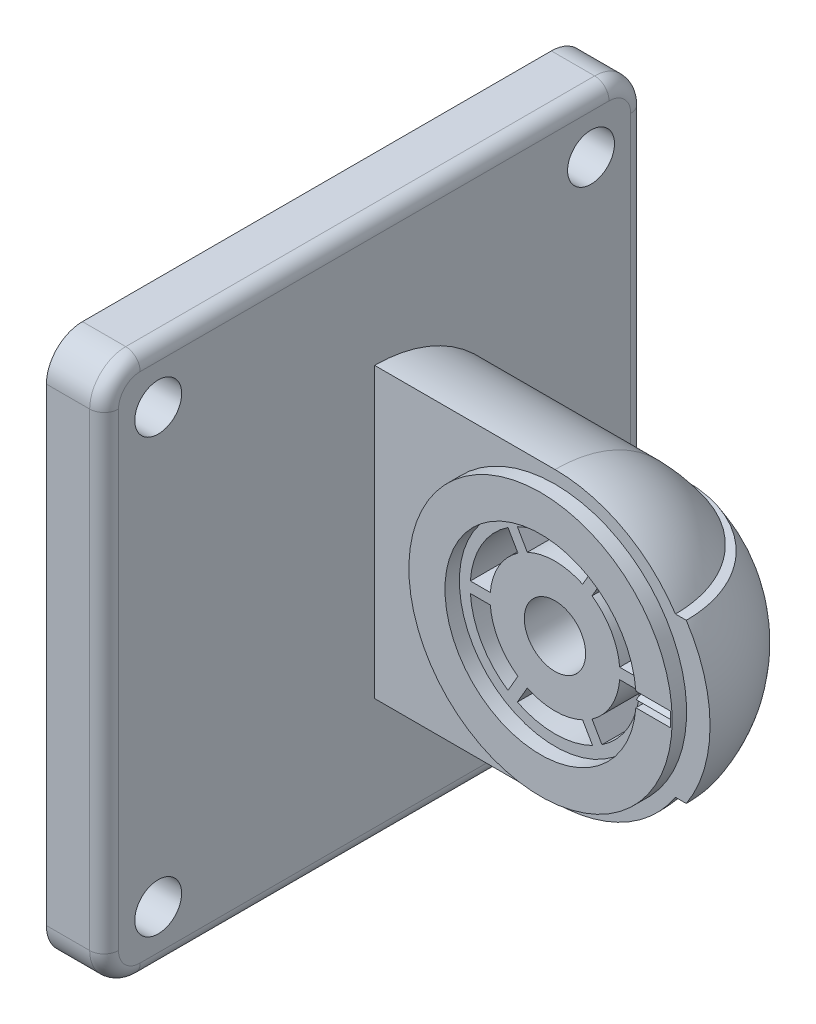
ISO-10303-21;
HEADER;
FILE_DESCRIPTION(('STEP AP214'),'2;1');
FILE_NAME('part.step','',(''),(''),'','','');
FILE_SCHEMA(('AUTOMOTIVE_DESIGN { 1 0 10303 214 1 1 1 1 }'));
ENDSEC;
DATA;
#1=APPLICATION_CONTEXT('core data for automotive mechanical design processes');
#2=APPLICATION_PROTOCOL_DEFINITION('international standard','automotive_design',2000,#1);
#3=PRODUCT_CONTEXT('',#1,'mechanical');
#4=PRODUCT('Part','Part','',(#3));
#5=PRODUCT_RELATED_PRODUCT_CATEGORY('part','',(#4));
#6=PRODUCT_DEFINITION_FORMATION('','',#4);
#7=PRODUCT_DEFINITION_CONTEXT('part definition',#1,'design');
#8=PRODUCT_DEFINITION('design','',#6,#7);
#9=PRODUCT_DEFINITION_SHAPE('','',#8);
#10=(LENGTH_UNIT() NAMED_UNIT(*) SI_UNIT(.MILLI.,.METRE.));
#11=(NAMED_UNIT(*) PLANE_ANGLE_UNIT() SI_UNIT($,.RADIAN.));
#12=(NAMED_UNIT(*) SI_UNIT($,.STERADIAN.) SOLID_ANGLE_UNIT());
#13=UNCERTAINTY_MEASURE_WITH_UNIT(LENGTH_MEASURE(1.E-05),#10,'distance_accuracy_value','');
#14=(GEOMETRIC_REPRESENTATION_CONTEXT(3) GLOBAL_UNCERTAINTY_ASSIGNED_CONTEXT((#13)) GLOBAL_UNIT_ASSIGNED_CONTEXT((#10,
#11,#12)) REPRESENTATION_CONTEXT('',''));
#15=CARTESIAN_POINT('',(0.,0.,0.));
#16=DIRECTION('',(0.,0.,1.));
#17=DIRECTION('',(1.,0.,0.));
#18=AXIS2_PLACEMENT_3D('',#15,#16,#17);
#19=CARTESIAN_POINT('',(33.0000000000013,0.,2.));
#20=DIRECTION('',(0.,0.,1.));
#21=DIRECTION('',(1.,0.,0.));
#22=AXIS2_PLACEMENT_3D('',#19,#20,#21);
#23=PLANE('',#22);
#24=CARTESIAN_POINT('',(33.0000000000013,0.,2.));
#25=DIRECTION('',(0.,0.,1.));
#26=DIRECTION('',(1.,0.,0.));
#27=AXIS2_PLACEMENT_3D('',#24,#25,#26);
#28=CIRCLE('',#27,18.25);
#29=CARTESIAN_POINT('',(51.2500000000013,0.,2.));
#30=VERTEX_POINT('',#29);
#31=EDGE_CURVE('E440',#30,#30,#28,.T.);
#32=ORIENTED_EDGE('',*,*,#31,.T.);
#33=EDGE_LOOP('',(#32));
#34=FACE_BOUND('',#33,.T.);
#35=DIRECTION('',(0.,1.,0.));
#36=VECTOR('',#35,1.);
#37=CARTESIAN_POINT('',(51.,-1.00000000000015,1.99999999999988));
#38=LINE('',#37,#36);
#39=CARTESIAN_POINT('',(51.,-1.00000000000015,1.99999999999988));
#40=VERTEX_POINT('',#39);
#41=CARTESIAN_POINT('',(51.0000000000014,1.50133697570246E-13,1.99999999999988));
#42=VERTEX_POINT('',#41);
#43=EDGE_CURVE('E405',#40,#42,#38,.T.);
#44=ORIENTED_EDGE('',*,*,#43,.F.);
#45=DIRECTION('',(1.,0.,0.));
#46=VECTOR('',#45,1.);
#47=CARTESIAN_POINT('',(46.,-1.00000000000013,1.99999999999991));
#48=LINE('',#47,#46);
#49=CARTESIAN_POINT('',(46.2122102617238,-1.00000000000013,1.99999999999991));
#50=VERTEX_POINT('',#49);
#51=EDGE_CURVE('E413',#50,#40,#48,.T.);
#52=ORIENTED_EDGE('',*,*,#51,.F.);
#53=CARTESIAN_POINT('',(33.0000000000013,0.,2.));
#54=DIRECTION('',(0.,0.,1.));
#55=DIRECTION('',(1.,0.,0.));
#56=AXIS2_PLACEMENT_3D('',#53,#54,#55);
#57=CIRCLE('',#56,13.25);
#58=CARTESIAN_POINT('',(46.2122102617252,1.00000000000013,1.99999999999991));
#59=VERTEX_POINT('',#58);
#60=EDGE_CURVE('E437',#59,#50,#57,.T.);
#61=ORIENTED_EDGE('',*,*,#60,.F.);
#62=DIRECTION('',(1.,0.,0.));
#63=VECTOR('',#62,1.);
#64=CARTESIAN_POINT('',(46.0000000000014,1.00000000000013,1.99999999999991));
#65=LINE('',#64,#63);
#66=CARTESIAN_POINT('',(51.0000000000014,1.00000000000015,1.99999999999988));
#67=VERTEX_POINT('',#66);
#68=EDGE_CURVE('E430',#59,#67,#65,.T.);
#69=ORIENTED_EDGE('',*,*,#68,.T.);
#70=DIRECTION('',(0.,-1.,0.));
#71=VECTOR('',#70,1.);
#72=CARTESIAN_POINT('',(51.0000000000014,1.00000000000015,1.99999999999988));
#73=LINE('',#72,#71);
#74=EDGE_CURVE('E420',#67,#42,#73,.T.);
#75=ORIENTED_EDGE('',*,*,#74,.T.);
#76=EDGE_LOOP('',(#44,#52,#61,#69,#75));
#77=FACE_BOUND('',#76,.T.);
#78=ADVANCED_FACE('F14',(#34,#77),#23,.T.);
#79=CARTESIAN_POINT('',(33.0000000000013,0.,2.));
#80=DIRECTION('',(0.,0.,-1.));
#81=DIRECTION('',(-1.,0.,0.));
#82=AXIS2_PLACEMENT_3D('',#79,#80,#81);
#83=CYLINDRICAL_SURFACE('',#82,13.25);
#84=CARTESIAN_POINT('',(33.,0.,0.));
#85=DIRECTION('',(0.,0.,1.));
#86=DIRECTION('',(1.,0.,0.));
#87=AXIS2_PLACEMENT_3D('',#84,#85,#86);
#88=CIRCLE('',#87,13.25);
#89=CARTESIAN_POINT('',(46.2122102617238,-1.00000000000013,1.11672823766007E-13));
#90=VERTEX_POINT('',#89);
#91=CARTESIAN_POINT('',(46.2122102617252,1.00000000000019,0.));
#92=VERTEX_POINT('',#91);
#93=EDGE_CURVE('E28',#90,#92,#88,.T.);
#94=ORIENTED_EDGE('',*,*,#93,.F.);
#95=CARTESIAN_POINT('',(33.0000000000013,0.,2.00000000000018));
#96=DIRECTION('',(0.,-0.894427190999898,0.447213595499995));
#97=DIRECTION('',(0.,-0.447213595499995,-0.894427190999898));
#98=AXIS2_PLACEMENT_3D('',#95,#96,#97);
#99=ELLIPSE('',#98,29.6279007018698,13.25);
#100=CARTESIAN_POINT('',(46.2500000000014,-1.33549161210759E-13,1.99999999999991));
#101=VERTEX_POINT('',#100);
#102=EDGE_CURVE('E416',#90,#101,#99,.T.);
#103=ORIENTED_EDGE('',*,*,#102,.T.);
#104=CARTESIAN_POINT('',(33.0000000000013,0.,2.00000000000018));
#105=DIRECTION('',(0.,-0.894427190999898,-0.447213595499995));
#106=DIRECTION('',(0.,0.447213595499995,-0.894427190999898));
#107=AXIS2_PLACEMENT_3D('',#104,#105,#106);
#108=ELLIPSE('',#107,29.6279007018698,13.25);
#109=EDGE_CURVE('E893',#92,#101,#108,.T.);
#110=ORIENTED_EDGE('',*,*,#109,.F.);
#111=EDGE_LOOP('',(#94,#103,#110));
#112=FACE_BOUND('',#111,.T.);
#113=ADVANCED_FACE('F904',(#112),#83,.F.);
#114=ORIENTED_EDGE('',*,*,#60,.T.);
#115=DIRECTION('',(0.,0.,-1.));
#116=VECTOR('',#115,1.);
#117=CARTESIAN_POINT('',(46.2122102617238,-1.00000000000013,2.));
#118=LINE('',#117,#116);
#119=EDGE_CURVE('E9',#50,#90,#118,.T.);
#120=ORIENTED_EDGE('',*,*,#119,.T.);
#121=EDGE_CURVE('E441',#92,#90,#88,.T.);
#122=ORIENTED_EDGE('',*,*,#121,.F.);
#123=DIRECTION('',(0.,0.,-1.));
#124=VECTOR('',#123,1.);
#125=CARTESIAN_POINT('',(46.2122102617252,1.00000000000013,2.));
#126=LINE('',#125,#124);
#127=EDGE_CURVE('E22',#59,#92,#126,.T.);
#128=ORIENTED_EDGE('',*,*,#127,.F.);
#129=EDGE_LOOP('',(#114,#120,#122,#128));
#130=FACE_BOUND('',#129,.T.);
#131=ADVANCED_FACE('F906',(#130),#83,.F.);
#132=CARTESIAN_POINT('',(33.,0.,0.));
#133=DIRECTION('',(0.,0.,-1.));
#134=DIRECTION('',(1.,0.,0.));
#135=AXIS2_PLACEMENT_3D('',#132,#133,#134);
#136=PLANE('',#135);
#137=ORIENTED_EDGE('',*,*,#121,.T.);
#138=ORIENTED_EDGE('',*,*,#93,.T.);
#139=EDGE_LOOP('',(#137,#138));
#140=FACE_BOUND('',#139,.T.);
#141=CARTESIAN_POINT('',(33.,0.,0.));
#142=DIRECTION('',(0.,0.,1.));
#143=DIRECTION('',(1.,0.,0.));
#144=AXIS2_PLACEMENT_3D('',#141,#142,#143);
#145=CIRCLE('',#144,4.25);
#146=CARTESIAN_POINT('',(37.25,0.,0.));
#147=VERTEX_POINT('',#146);
#148=EDGE_CURVE('E670',#147,#147,#145,.T.);
#149=ORIENTED_EDGE('',*,*,#148,.F.);
#150=EDGE_LOOP('',(#149));
#151=FACE_BOUND('',#150,.T.);
#152=DIRECTION('',(1.,0.,0.));
#153=VECTOR('',#152,1.);
#154=CARTESIAN_POINT('',(41.9686955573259,0.750000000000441,0.));
#155=LINE('',#154,#153);
#156=CARTESIAN_POINT('',(41.9686955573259,0.750000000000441,0.));
#157=VERTEX_POINT('',#156);
#158=CARTESIAN_POINT('',(44.7260393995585,0.750000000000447,0.));
#159=VERTEX_POINT('',#158);
#160=EDGE_CURVE('E619',#157,#159,#155,.T.);
#161=ORIENTED_EDGE('',*,*,#160,.F.);
#162=CARTESIAN_POINT('',(33.,0.,0.));
#163=DIRECTION('',(0.,0.,-1.));
#164=DIRECTION('',(1.,0.,0.));
#165=AXIS2_PLACEMENT_3D('',#162,#163,#164);
#166=CIRCLE('',#165,8.99999999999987);
#167=CARTESIAN_POINT('',(38.1338668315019,7.3921181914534,0.));
#168=VERTEX_POINT('',#167);
#169=EDGE_CURVE('E597',#168,#157,#166,.T.);
#170=ORIENTED_EDGE('',*,*,#169,.F.);
#171=DIRECTION('',(-0.5,-0.866025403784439,0.));
#172=VECTOR('',#171,1.);
#173=CARTESIAN_POINT('',(38.1338668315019,7.3921181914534,0.));
#174=LINE('',#173,#172);
#175=CARTESIAN_POINT('',(39.5125387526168,9.78004800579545,0.));
#176=VERTEX_POINT('',#175);
#177=EDGE_CURVE('E608',#176,#168,#174,.T.);
#178=ORIENTED_EDGE('',*,*,#177,.F.);
#179=CARTESIAN_POINT('',(33.,0.,0.));
#180=DIRECTION('',(0.,0.,1.));
#181=DIRECTION('',(1.,0.,0.));
#182=AXIS2_PLACEMENT_3D('',#179,#180,#181);
#183=CIRCLE('',#182,11.75);
#184=EDGE_CURVE('E622',#159,#176,#183,.T.);
#185=ORIENTED_EDGE('',*,*,#184,.F.);
#186=EDGE_LOOP('',(#161,#170,#178,#185));
#187=FACE_BOUND('',#186,.T.);
#188=DIRECTION('',(0.5,-0.866025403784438,0.));
#189=VECTOR('',#188,1.);
#190=CARTESIAN_POINT('',(29.1651712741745,8.14211819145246,0.));
#191=LINE('',#190,#189);
#192=CARTESIAN_POINT('',(27.7864993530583,10.5300480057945,0.));
#193=VERTEX_POINT('',#192);
#194=CARTESIAN_POINT('',(29.1651712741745,8.14211819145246,0.));
#195=VERTEX_POINT('',#194);
#196=EDGE_CURVE('E461',#193,#195,#191,.T.);
#197=ORIENTED_EDGE('',*,*,#196,.F.);
#198=CARTESIAN_POINT('',(33.,0.,0.));
#199=DIRECTION('',(0.,0.,1.));
#200=DIRECTION('',(1.,0.,0.));
#201=AXIS2_PLACEMENT_3D('',#198,#199,#200);
#202=CIRCLE('',#201,11.75);
#203=CARTESIAN_POINT('',(38.2135006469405,10.5300480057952,0.));
#204=VERTEX_POINT('',#203);
#205=EDGE_CURVE('E445',#204,#193,#202,.T.);
#206=ORIENTED_EDGE('',*,*,#205,.F.);
#207=DIRECTION('',(0.5,0.86602540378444,0.));
#208=VECTOR('',#207,1.);
#209=CARTESIAN_POINT('',(36.8348287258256,8.14211819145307,0.));
#210=LINE('',#209,#208);
#211=CARTESIAN_POINT('',(36.8348287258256,8.14211819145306,0.));
#212=VERTEX_POINT('',#211);
#213=EDGE_CURVE('E450',#212,#204,#210,.T.);
#214=ORIENTED_EDGE('',*,*,#213,.F.);
#215=CARTESIAN_POINT('',(33.,0.,0.));
#216=DIRECTION('',(0.,0.,-1.));
#217=DIRECTION('',(1.,0.,0.));
#218=AXIS2_PLACEMENT_3D('',#215,#216,#217);
#219=CIRCLE('',#218,8.99999999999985);
#220=EDGE_CURVE('E464',#195,#212,#219,.T.);
#221=ORIENTED_EDGE('',*,*,#220,.F.);
#222=EDGE_LOOP('',(#197,#206,#214,#221));
#223=FACE_BOUND('',#222,.T.);
#224=DIRECTION('',(-0.5,0.866025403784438,0.));
#225=VECTOR('',#224,1.);
#226=CARTESIAN_POINT('',(36.8348287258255,-8.1421181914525,0.));
#227=LINE('',#226,#225);
#228=CARTESIAN_POINT('',(38.2135006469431,-10.5300480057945,0.));
#229=VERTEX_POINT('',#228);
#230=CARTESIAN_POINT('',(36.8348287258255,-8.1421181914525,0.));
#231=VERTEX_POINT('',#230);
#232=EDGE_CURVE('E555',#229,#231,#227,.T.);
#233=ORIENTED_EDGE('',*,*,#232,.F.);
#234=CARTESIAN_POINT('',(33.,0.,0.));
#235=DIRECTION('',(0.,0.,1.));
#236=DIRECTION('',(1.,0.,0.));
#237=AXIS2_PLACEMENT_3D('',#234,#235,#236);
#238=CIRCLE('',#237,11.75);
#239=CARTESIAN_POINT('',(27.7864993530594,-10.5300480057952,0.));
#240=VERTEX_POINT('',#239);
#241=EDGE_CURVE('E504',#240,#229,#238,.T.);
#242=ORIENTED_EDGE('',*,*,#241,.F.);
#243=DIRECTION('',(-0.5,-0.86602540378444,0.));
#244=VECTOR('',#243,1.);
#245=CARTESIAN_POINT('',(29.1651712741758,-8.14211819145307,0.));
#246=LINE('',#245,#244);
#247=CARTESIAN_POINT('',(29.1651712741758,-8.14211819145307,0.));
#248=VERTEX_POINT('',#247);
#249=EDGE_CURVE('E544',#248,#240,#246,.T.);
#250=ORIENTED_EDGE('',*,*,#249,.F.);
#251=CARTESIAN_POINT('',(33.,0.,0.));
#252=DIRECTION('',(0.,0.,-1.));
#253=DIRECTION('',(1.,0.,0.));
#254=AXIS2_PLACEMENT_3D('',#251,#252,#253);
#255=CIRCLE('',#254,8.99999999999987);
#256=EDGE_CURVE('E558',#231,#248,#255,.T.);
#257=ORIENTED_EDGE('',*,*,#256,.F.);
#258=EDGE_LOOP('',(#233,#242,#250,#257));
#259=FACE_BOUND('',#258,.T.);
#260=DIRECTION('',(-1.,0.,0.));
#261=VECTOR('',#260,1.);
#262=CARTESIAN_POINT('',(41.9686955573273,-0.749999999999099,0.));
#263=LINE('',#262,#261);
#264=CARTESIAN_POINT('',(44.72603939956,-0.749999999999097,0.));
#265=VERTEX_POINT('',#264);
#266=CARTESIAN_POINT('',(41.9686955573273,-0.749999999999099,0.));
#267=VERTEX_POINT('',#266);
#268=EDGE_CURVE('E587',#265,#267,#263,.T.);
#269=ORIENTED_EDGE('',*,*,#268,.F.);
#270=CARTESIAN_POINT('',(33.,0.,0.));
#271=DIRECTION('',(0.,0.,1.));
#272=DIRECTION('',(1.,0.,0.));
#273=AXIS2_PLACEMENT_3D('',#270,#271,#272);
#274=CIRCLE('',#273,11.75);
#275=CARTESIAN_POINT('',(39.5125387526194,-9.78004800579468,0.));
#276=VERTEX_POINT('',#275);
#277=EDGE_CURVE('E565',#276,#265,#274,.T.);
#278=ORIENTED_EDGE('',*,*,#277,.F.);
#279=DIRECTION('',(0.500000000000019,-0.866025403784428,0.));
#280=VECTOR('',#279,1.);
#281=CARTESIAN_POINT('',(38.1338668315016,-7.39211819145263,0.));
#282=LINE('',#281,#280);
#283=CARTESIAN_POINT('',(38.1338668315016,-7.39211819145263,0.));
#284=VERTEX_POINT('',#283);
#285=EDGE_CURVE('E576',#284,#276,#282,.T.);
#286=ORIENTED_EDGE('',*,*,#285,.F.);
#287=CARTESIAN_POINT('',(33.,0.,0.));
#288=DIRECTION('',(0.,0.,-1.));
#289=DIRECTION('',(1.,0.,0.));
#290=AXIS2_PLACEMENT_3D('',#287,#288,#289);
#291=CIRCLE('',#290,8.99999999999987);
#292=EDGE_CURVE('E590',#267,#284,#291,.T.);
#293=ORIENTED_EDGE('',*,*,#292,.F.);
#294=EDGE_LOOP('',(#269,#278,#286,#293));
#295=FACE_BOUND('',#294,.T.);
#296=DIRECTION('',(0.5,0.86602540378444,0.));
#297=VECTOR('',#296,1.);
#298=CARTESIAN_POINT('',(27.8661331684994,-7.3921181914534,0.));
#299=LINE('',#298,#297);
#300=CARTESIAN_POINT('',(26.4874612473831,-9.78004800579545,0.));
#301=VERTEX_POINT('',#300);
#302=CARTESIAN_POINT('',(27.8661331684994,-7.3921181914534,0.));
#303=VERTEX_POINT('',#302);
#304=EDGE_CURVE('E493',#301,#303,#299,.T.);
#305=ORIENTED_EDGE('',*,*,#304,.F.);
#306=CARTESIAN_POINT('',(33.,0.,0.));
#307=DIRECTION('',(0.,0.,1.));
#308=DIRECTION('',(1.,0.,0.));
#309=AXIS2_PLACEMENT_3D('',#306,#307,#308);
#310=CIRCLE('',#309,11.75);
#311=CARTESIAN_POINT('',(21.2739606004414,-0.750000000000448,0.));
#312=VERTEX_POINT('',#311);
#313=EDGE_CURVE('E491',#312,#301,#310,.T.);
#314=ORIENTED_EDGE('',*,*,#313,.F.);
#315=DIRECTION('',(-1.,0.,0.));
#316=VECTOR('',#315,1.);
#317=CARTESIAN_POINT('',(24.0313044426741,-0.750000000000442,0.));
#318=LINE('',#317,#316);
#319=CARTESIAN_POINT('',(24.0313044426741,-0.750000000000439,0.));
#320=VERTEX_POINT('',#319);
#321=EDGE_CURVE('E481',#320,#312,#318,.T.);
#322=ORIENTED_EDGE('',*,*,#321,.F.);
#323=CARTESIAN_POINT('',(33.,0.,0.));
#324=DIRECTION('',(0.,0.,-1.));
#325=DIRECTION('',(1.,0.,0.));
#326=AXIS2_PLACEMENT_3D('',#323,#324,#325);
#327=CIRCLE('',#326,8.99999999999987);
#328=EDGE_CURVE('E497',#303,#320,#327,.T.);
#329=ORIENTED_EDGE('',*,*,#328,.F.);
#330=EDGE_LOOP('',(#305,#314,#322,#329));
#331=FACE_BOUND('',#330,.T.);
#332=DIRECTION('',(1.,0.,0.));
#333=VECTOR('',#332,1.);
#334=CARTESIAN_POINT('',(24.031304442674,0.749999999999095,0.));
#335=LINE('',#334,#333);
#336=CARTESIAN_POINT('',(21.2739606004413,0.749999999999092,0.));
#337=VERTEX_POINT('',#336);
#338=CARTESIAN_POINT('',(24.031304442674,0.749999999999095,0.));
#339=VERTEX_POINT('',#338);
#340=EDGE_CURVE('E526',#337,#339,#335,.T.);
#341=ORIENTED_EDGE('',*,*,#340,.F.);
#342=CARTESIAN_POINT('',(33.,0.,0.));
#343=DIRECTION('',(0.,0.,1.));
#344=DIRECTION('',(1.,0.,0.));
#345=AXIS2_PLACEMENT_3D('',#342,#343,#344);
#346=CIRCLE('',#345,11.75);
#347=CARTESIAN_POINT('',(26.487461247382,9.7800480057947,0.));
#348=VERTEX_POINT('',#347);
#349=EDGE_CURVE('E36',#348,#337,#346,.T.);
#350=ORIENTED_EDGE('',*,*,#349,.F.);
#351=DIRECTION('',(-0.5,0.866025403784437,0.));
#352=VECTOR('',#351,1.);
#353=CARTESIAN_POINT('',(27.8661331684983,7.39211819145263,0.));
#354=LINE('',#353,#352);
#355=CARTESIAN_POINT('',(27.8661331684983,7.39211819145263,0.));
#356=VERTEX_POINT('',#355);
#357=EDGE_CURVE('E515',#356,#348,#354,.T.);
#358=ORIENTED_EDGE('',*,*,#357,.F.);
#359=CARTESIAN_POINT('',(33.,0.,0.));
#360=DIRECTION('',(0.,0.,-1.));
#361=DIRECTION('',(1.,0.,0.));
#362=AXIS2_PLACEMENT_3D('',#359,#360,#361);
#363=CIRCLE('',#362,8.99999999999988);
#364=EDGE_CURVE('E529',#339,#356,#363,.T.);
#365=ORIENTED_EDGE('',*,*,#364,.F.);
#366=EDGE_LOOP('',(#341,#350,#358,#365));
#367=FACE_BOUND('',#366,.T.);
#368=ADVANCED_FACE('F907',(#140,#151,#187,#223,#259,#295,#331,#367),#136,.F.);
#369=CARTESIAN_POINT('',(54.5,0.,0.));
#370=DIRECTION('',(-1.,0.,0.));
#371=DIRECTION('',(0.,0.,1.));
#372=AXIS2_PLACEMENT_3D('',#369,#370,#371);
#373=CYLINDRICAL_SURFACE('',#372,20.);
#374=DIRECTION('',(-1.,0.,0.));
#375=VECTOR('',#374,1.);
#376=CARTESIAN_POINT('',(54.5,6.75,-18.8265105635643));
#377=LINE('',#376,#375);
#378=CARTESIAN_POINT('',(29.1028856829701,6.75,-18.8265105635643));
#379=VERTEX_POINT('',#378);
#380=CARTESIAN_POINT('',(34.5,6.75,-18.8265105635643));
#381=VERTEX_POINT('',#380);
#382=EDGE_CURVE('E668',#379,#381,#377,.F.);
#383=ORIENTED_EDGE('',*,*,#382,.F.);
#384=CARTESIAN_POINT('',(25.20577136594,0.,0.));
#385=DIRECTION('',(-0.866025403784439,0.5,0.));
#386=DIRECTION('',(-0.5,-0.866025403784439,0.));
#387=AXIS2_PLACEMENT_3D('',#384,#385,#386);
#388=ELLIPSE('',#387,23.0940107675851,20.);
#389=CARTESIAN_POINT('',(25.20577136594,0.,-20.));
#390=VERTEX_POINT('',#389);
#391=EDGE_CURVE('E888',#390,#379,#388,.F.);
#392=ORIENTED_EDGE('',*,*,#391,.F.);
#393=CARTESIAN_POINT('',(25.20577136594,0.,0.));
#394=DIRECTION('',(-0.866025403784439,-0.5,0.));
#395=DIRECTION('',(-0.5,0.866025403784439,0.));
#396=AXIS2_PLACEMENT_3D('',#393,#394,#395);
#397=ELLIPSE('',#396,23.0940107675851,20.);
#398=CARTESIAN_POINT('',(29.1028856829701,-6.75,-18.8265105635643));
#399=VERTEX_POINT('',#398);
#400=EDGE_CURVE('E886',#399,#390,#397,.F.);
#401=ORIENTED_EDGE('',*,*,#400,.F.);
#402=DIRECTION('',(-1.,0.,0.));
#403=VECTOR('',#402,1.);
#404=CARTESIAN_POINT('',(54.5,-6.75,-18.8265105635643));
#405=LINE('',#404,#403);
#406=CARTESIAN_POINT('',(34.5,-6.75,-18.8265105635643));
#407=VERTEX_POINT('',#406);
#408=EDGE_CURVE('E666',#407,#399,#405,.T.);
#409=ORIENTED_EDGE('',*,*,#408,.F.);
#410=CARTESIAN_POINT('',(34.5,0.,0.));
#411=DIRECTION('',(-1.,0.,0.));
#412=DIRECTION('',(0.,0.,1.));
#413=AXIS2_PLACEMENT_3D('',#410,#411,#412);
#414=CIRCLE('',#413,20.);
#415=CARTESIAN_POINT('',(34.5,-11.,-16.7032930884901));
#416=VERTEX_POINT('',#415);
#417=EDGE_CURVE('E865',#407,#416,#414,.T.);
#418=ORIENTED_EDGE('',*,*,#417,.T.);
#419=DIRECTION('',(-1.,0.,0.));
#420=VECTOR('',#419,1.);
#421=CARTESIAN_POINT('',(54.5,-11.,-16.7032930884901));
#422=LINE('',#421,#420);
#423=CARTESIAN_POINT('',(33.,-11.,-16.7032930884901));
#424=VERTEX_POINT('',#423);
#425=EDGE_CURVE('E848',#424,#416,#422,.F.);
#426=ORIENTED_EDGE('',*,*,#425,.F.);
#427=CARTESIAN_POINT('',(33.,0.,0.));
#428=DIRECTION('',(-1.,0.,0.));
#429=DIRECTION('',(0.,0.,1.));
#430=AXIS2_PLACEMENT_3D('',#427,#428,#429);
#431=CIRCLE('',#430,20.);
#432=CARTESIAN_POINT('',(33.,-20.,0.));
#433=VERTEX_POINT('',#432);
#434=EDGE_CURVE('E685',#424,#433,#431,.T.);
#435=ORIENTED_EDGE('',*,*,#434,.T.);
#436=DIRECTION('',(1.,0.,0.));
#437=VECTOR('',#436,1.);
#438=CARTESIAN_POINT('',(8.00000000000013,-20.,0.));
#439=LINE('',#438,#437);
#440=CARTESIAN_POINT('',(8.00000000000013,-20.,0.));
#441=VERTEX_POINT('',#440);
#442=EDGE_CURVE('E673',#441,#433,#439,.T.);
#443=ORIENTED_EDGE('',*,*,#442,.F.);
#444=CARTESIAN_POINT('',(8.00000000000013,0.,0.));
#445=DIRECTION('',(-1.,0.,0.));
#446=DIRECTION('',(0.,0.,1.));
#447=AXIS2_PLACEMENT_3D('',#444,#445,#446);
#448=CIRCLE('',#447,20.);
#449=CARTESIAN_POINT('',(7.99999999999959,20.,1.37693675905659E-13));
#450=VERTEX_POINT('',#449);
#451=EDGE_CURVE('E689',#450,#441,#448,.T.);
#452=ORIENTED_EDGE('',*,*,#451,.F.);
#453=DIRECTION('',(1.,0.,0.));
#454=VECTOR('',#453,1.);
#455=CARTESIAN_POINT('',(7.99999999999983,20.,1.39645239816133E-13));
#456=LINE('',#455,#454);
#457=CARTESIAN_POINT('',(33.0000000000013,20.,1.39645239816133E-13));
#458=VERTEX_POINT('',#457);
#459=EDGE_CURVE('E679',#450,#458,#456,.T.);
#460=ORIENTED_EDGE('',*,*,#459,.T.);
#461=CARTESIAN_POINT('',(33.,11.,-16.70329308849));
#462=VERTEX_POINT('',#461);
#463=EDGE_CURVE('E686',#458,#462,#431,.T.);
#464=ORIENTED_EDGE('',*,*,#463,.T.);
#465=DIRECTION('',(-1.,0.,0.));
#466=VECTOR('',#465,1.);
#467=CARTESIAN_POINT('',(54.5,11.,-16.7032930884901));
#468=LINE('',#467,#466);
#469=CARTESIAN_POINT('',(34.5,11.,-16.7032930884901));
#470=VERTEX_POINT('',#469);
#471=EDGE_CURVE('E856',#470,#462,#468,.T.);
#472=ORIENTED_EDGE('',*,*,#471,.F.);
#473=EDGE_CURVE('E866',#470,#381,#414,.T.);
#474=ORIENTED_EDGE('',*,*,#473,.T.);
#475=EDGE_LOOP('',(#383,#392,#401,#409,#418,#426,#435,#443,#452,#460,#464,#472,#474));
#476=FACE_BOUND('',#475,.T.);
#477=ADVANCED_FACE('F16',(#476),#373,.T.);
#478=CARTESIAN_POINT('',(34.5,0.,0.));
#479=DIRECTION('',(-1.,0.,0.));
#480=DIRECTION('',(0.,1.,0.));
#481=AXIS2_PLACEMENT_3D('',#478,#479,#480);
#482=SPHERICAL_SURFACE('',#481,20.);
#483=CARTESIAN_POINT('',(34.5,6.75,0.));
#484=DIRECTION('',(0.,1.,0.));
#485=DIRECTION('',(0.,0.,1.));
#486=AXIS2_PLACEMENT_3D('',#483,#484,#485);
#487=CIRCLE('',#486,18.8265105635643);
#488=CARTESIAN_POINT('',(36.8971143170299,6.75,-18.6732788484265));
#489=VERTEX_POINT('',#488);
#490=EDGE_CURVE('E884',#381,#489,#487,.F.);
#491=ORIENTED_EDGE('',*,*,#490,.F.);
#492=ORIENTED_EDGE('',*,*,#473,.F.);
#493=CARTESIAN_POINT('',(34.5000000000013,11.,0.));
#494=DIRECTION('',(0.,-1.,0.));
#495=DIRECTION('',(0.,0.,-1.));
#496=AXIS2_PLACEMENT_3D('',#493,#494,#495);
#497=CIRCLE('',#496,16.7032930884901);
#498=CARTESIAN_POINT('',(51.2032930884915,11.,0.));
#499=VERTEX_POINT('',#498);
#500=EDGE_CURVE('E854',#499,#470,#497,.F.);
#501=ORIENTED_EDGE('',*,*,#500,.F.);
#502=CARTESIAN_POINT('',(34.5,0.,0.));
#503=DIRECTION('',(0.,0.,-1.));
#504=DIRECTION('',(1.,0.,0.));
#505=AXIS2_PLACEMENT_3D('',#502,#503,#504);
#506=CIRCLE('',#505,20.);
#507=CARTESIAN_POINT('',(51.2032930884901,-11.,0.));
#508=VERTEX_POINT('',#507);
#509=EDGE_CURVE('E862',#499,#508,#506,.T.);
#510=ORIENTED_EDGE('',*,*,#509,.T.);
#511=CARTESIAN_POINT('',(34.5,-11.,0.));
#512=DIRECTION('',(0.,1.,0.));
#513=DIRECTION('',(0.,0.,1.));
#514=AXIS2_PLACEMENT_3D('',#511,#512,#513);
#515=CIRCLE('',#514,16.70329308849);
#516=EDGE_CURVE('E844',#416,#508,#515,.F.);
#517=ORIENTED_EDGE('',*,*,#516,.F.);
#518=ORIENTED_EDGE('',*,*,#417,.F.);
#519=CARTESIAN_POINT('',(34.5000000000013,-6.75,0.));
#520=DIRECTION('',(0.,-1.,0.));
#521=DIRECTION('',(1.,0.,0.));
#522=AXIS2_PLACEMENT_3D('',#519,#520,#521);
#523=CIRCLE('',#522,18.8265105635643);
#524=CARTESIAN_POINT('',(36.89711431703,-6.75,-18.6732788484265));
#525=VERTEX_POINT('',#524);
#526=EDGE_CURVE('E875',#525,#407,#523,.F.);
#527=ORIENTED_EDGE('',*,*,#526,.F.);
#528=CARTESIAN_POINT('',(39.2206714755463,-2.72548094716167,0.));
#529=DIRECTION('',(0.866025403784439,-0.5,0.));
#530=DIRECTION('',(0.5,0.866025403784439,0.));
#531=AXIS2_PLACEMENT_3D('',#528,#529,#530);
#532=CIRCLE('',#531,19.242843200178);
#533=CARTESIAN_POINT('',(40.7942286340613,0.,-18.9837479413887));
#534=VERTEX_POINT('',#533);
#535=EDGE_CURVE('E879',#534,#525,#532,.F.);
#536=ORIENTED_EDGE('',*,*,#535,.F.);
#537=CARTESIAN_POINT('',(39.2206714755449,2.72548094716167,0.));
#538=DIRECTION('',(0.866025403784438,0.5,0.));
#539=DIRECTION('',(-0.5,0.866025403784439,0.));
#540=AXIS2_PLACEMENT_3D('',#537,#538,#539);
#541=CIRCLE('',#540,19.242843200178);
#542=EDGE_CURVE('E882',#489,#534,#541,.F.);
#543=ORIENTED_EDGE('',*,*,#542,.F.);
#544=EDGE_LOOP('',(#491,#492,#501,#510,#517,#518,#527,#536,#543));
#545=FACE_BOUND('',#544,.T.);
#546=ADVANCED_FACE('F1602',(#545),#482,.T.);
#547=CARTESIAN_POINT('',(33.,0.,0.));
#548=DIRECTION('',(0.,0.,-1.));
#549=DIRECTION('',(0.,1.,0.));
#550=AXIS2_PLACEMENT_3D('',#547,#548,#549);
#551=CIRCLE('',#550,18.25);
#552=CARTESIAN_POINT('',(33.,18.25,1.27439068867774E-13));
#553=VERTEX_POINT('',#552);
#554=EDGE_CURVE('E890',#553,#553,#551,.F.);
#555=ORIENTED_EDGE('',*,*,#554,.F.);
#556=EDGE_LOOP('',(#555));
#557=FACE_BOUND('',#556,.T.);
#558=ORIENTED_EDGE('',*,*,#509,.F.);
#559=DIRECTION('',(-1.,0.,0.));
#560=VECTOR('',#559,1.);
#561=CARTESIAN_POINT('',(33.0000000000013,11.,0.));
#562=LINE('',#561,#560);
#563=CARTESIAN_POINT('',(49.7032930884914,11.,0.));
#564=VERTEX_POINT('',#563);
#565=EDGE_CURVE('E872',#499,#564,#562,.T.);
#566=ORIENTED_EDGE('',*,*,#565,.T.);
#567=CARTESIAN_POINT('',(33.,0.,0.));
#568=DIRECTION('',(0.,0.,-1.));
#569=DIRECTION('',(1.,0.,0.));
#570=AXIS2_PLACEMENT_3D('',#567,#568,#569);
#571=CIRCLE('',#570,20.);
#572=EDGE_CURVE('E683',#458,#564,#571,.T.);
#573=ORIENTED_EDGE('',*,*,#572,.F.);
#574=ORIENTED_EDGE('',*,*,#459,.F.);
#575=DIRECTION('',(0.,1.,0.));
#576=VECTOR('',#575,1.);
#577=CARTESIAN_POINT('',(8.,0.,0.));
#578=LINE('',#577,#576);
#579=EDGE_CURVE('E676',#441,#450,#578,.T.);
#580=ORIENTED_EDGE('',*,*,#579,.F.);
#581=ORIENTED_EDGE('',*,*,#442,.T.);
#582=CARTESIAN_POINT('',(49.7032930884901,-11.,0.));
#583=VERTEX_POINT('',#582);
#584=EDGE_CURVE('E682',#583,#433,#571,.T.);
#585=ORIENTED_EDGE('',*,*,#584,.F.);
#586=DIRECTION('',(1.,0.,0.));
#587=VECTOR('',#586,1.);
#588=CARTESIAN_POINT('',(33.,-11.,0.));
#589=LINE('',#588,#587);
#590=EDGE_CURVE('E869',#583,#508,#589,.T.);
#591=ORIENTED_EDGE('',*,*,#590,.T.);
#592=EDGE_LOOP('',(#558,#566,#573,#574,#580,#581,#585,#591));
#593=FACE_BOUND('',#592,.T.);
#594=ADVANCED_FACE('F911',(#557,#593),#136,.F.);
#595=CARTESIAN_POINT('',(26.7611252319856,-11.,-37.5));
#596=DIRECTION('',(0.,1.,0.));
#597=DIRECTION('',(0.,0.,1.));
#598=AXIS2_PLACEMENT_3D('',#595,#596,#597);
#599=PLANE('',#598);
#600=CARTESIAN_POINT('',(33.,-11.,0.));
#601=DIRECTION('',(0.,1.,0.));
#602=DIRECTION('',(0.,0.,1.));
#603=AXIS2_PLACEMENT_3D('',#600,#601,#602);
#604=CIRCLE('',#603,16.70329308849);
#605=EDGE_CURVE('E851',#583,#424,#604,.T.);
#606=ORIENTED_EDGE('',*,*,#605,.T.);
#607=ORIENTED_EDGE('',*,*,#425,.T.);
#608=ORIENTED_EDGE('',*,*,#516,.T.);
#609=ORIENTED_EDGE('',*,*,#590,.F.);
#610=EDGE_LOOP('',(#606,#607,#608,#609));
#611=FACE_BOUND('',#610,.T.);
#612=ADVANCED_FACE('F1585',(#611),#599,.F.);
#613=CARTESIAN_POINT('',(26.7611252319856,11.,-37.5));
#614=DIRECTION('',(0.,-1.,0.));
#615=DIRECTION('',(0.,0.,-1.));
#616=AXIS2_PLACEMENT_3D('',#613,#614,#615);
#617=PLANE('',#616);
#618=CARTESIAN_POINT('',(33.0000000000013,11.,0.));
#619=DIRECTION('',(0.,-1.,0.));
#620=DIRECTION('',(0.,0.,-1.));
#621=AXIS2_PLACEMENT_3D('',#618,#619,#620);
#622=CIRCLE('',#621,16.7032930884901);
#623=EDGE_CURVE('E859',#462,#564,#622,.T.);
#624=ORIENTED_EDGE('',*,*,#623,.T.);
#625=ORIENTED_EDGE('',*,*,#565,.F.);
#626=ORIENTED_EDGE('',*,*,#500,.T.);
#627=ORIENTED_EDGE('',*,*,#471,.T.);
#628=EDGE_LOOP('',(#624,#625,#626,#627));
#629=FACE_BOUND('',#628,.T.);
#630=ADVANCED_FACE('F1577',(#629),#617,.F.);
#631=CARTESIAN_POINT('',(33.,0.,0.));
#632=DIRECTION('',(-1.,0.,0.));
#633=DIRECTION('',(0.,1.,0.));
#634=AXIS2_PLACEMENT_3D('',#631,#632,#633);
#635=SPHERICAL_SURFACE('',#634,20.);
#636=ORIENTED_EDGE('',*,*,#623,.F.);
#637=ORIENTED_EDGE('',*,*,#463,.F.);
#638=ORIENTED_EDGE('',*,*,#572,.T.);
#639=EDGE_LOOP('',(#636,#637,#638));
#640=FACE_BOUND('',#639,.T.);
#641=ADVANCED_FACE('F1568',(#640),#635,.T.);
#642=ORIENTED_EDGE('',*,*,#605,.F.);
#643=ORIENTED_EDGE('',*,*,#584,.T.);
#644=ORIENTED_EDGE('',*,*,#434,.F.);
#645=EDGE_LOOP('',(#642,#643,#644));
#646=FACE_BOUND('',#645,.T.);
#647=ADVANCED_FACE('F1559',(#646),#635,.T.);
#648=CARTESIAN_POINT('',(8.00000000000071,-35.5000000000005,35.5));
#649=DIRECTION('',(1.,0.,0.));
#650=DIRECTION('',(0.,0.,-1.));
#651=AXIS2_PLACEMENT_3D('',#648,#649,#650);
#652=PLANE('',#651);
#653=ORIENTED_EDGE('',*,*,#451,.T.);
#654=ORIENTED_EDGE('',*,*,#579,.T.);
#655=EDGE_LOOP('',(#653,#654));
#656=FACE_BOUND('',#655,.T.);
#657=DIRECTION('',(0.,-1.,0.));
#658=VECTOR('',#657,1.);
#659=CARTESIAN_POINT('',(8.00000000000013,32.5000000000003,35.5));
#660=LINE('',#659,#658);
#661=CARTESIAN_POINT('',(8.00000000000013,32.5000000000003,35.5));
#662=VERTEX_POINT('',#661);
#663=CARTESIAN_POINT('',(8.0000000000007,-32.5000000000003,35.5));
#664=VERTEX_POINT('',#663);
#665=EDGE_CURVE('E692',#662,#664,#660,.T.);
#666=ORIENTED_EDGE('',*,*,#665,.T.);
#667=CARTESIAN_POINT('',(8.00000000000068,-32.5000000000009,32.5000000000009));
#668=DIRECTION('',(1.,0.,0.));
#669=DIRECTION('',(0.,1.84741111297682E-13,1.));
#670=AXIS2_PLACEMENT_3D('',#667,#668,#669);
#671=CIRCLE('',#670,2.99999999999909);
#672=CARTESIAN_POINT('',(8.00000000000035,-35.5,32.5000000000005));
#673=VERTEX_POINT('',#672);
#674=EDGE_CURVE('E695',#664,#673,#671,.T.);
#675=ORIENTED_EDGE('',*,*,#674,.T.);
#676=DIRECTION('',(0.,0.,-1.));
#677=VECTOR('',#676,1.);
#678=CARTESIAN_POINT('',(8.00000000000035,-35.5,32.5000000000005));
#679=LINE('',#678,#677);
#680=CARTESIAN_POINT('',(7.9999999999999,-35.5,-32.5));
#681=VERTEX_POINT('',#680);
#682=EDGE_CURVE('E700',#673,#681,#679,.T.);
#683=ORIENTED_EDGE('',*,*,#682,.T.);
#684=CARTESIAN_POINT('',(7.99999999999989,-32.5000000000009,-32.5000000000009));
#685=DIRECTION('',(1.,0.,0.));
#686=DIRECTION('',(0.,-1.,3.05533376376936E-13));
#687=AXIS2_PLACEMENT_3D('',#684,#685,#686);
#688=CIRCLE('',#687,2.99999999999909);
#689=CARTESIAN_POINT('',(7.99999999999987,-32.5000000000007,-35.5));
#690=VERTEX_POINT('',#689);
#691=EDGE_CURVE('E705',#681,#690,#688,.T.);
#692=ORIENTED_EDGE('',*,*,#691,.T.);
#693=DIRECTION('',(0.,1.,0.));
#694=VECTOR('',#693,1.);
#695=CARTESIAN_POINT('',(7.99999999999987,-32.5000000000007,-35.5));
#696=LINE('',#695,#694);
#697=CARTESIAN_POINT('',(7.9999999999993,32.5,-35.5));
#698=VERTEX_POINT('',#697);
#699=EDGE_CURVE('E710',#690,#698,#696,.T.);
#700=ORIENTED_EDGE('',*,*,#699,.T.);
#701=CARTESIAN_POINT('',(7.99999999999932,32.5000000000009,-32.5000000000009));
#702=DIRECTION('',(1.,0.,0.));
#703=DIRECTION('',(0.,-2.74743191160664E-13,-1.));
#704=AXIS2_PLACEMENT_3D('',#701,#702,#703);
#705=CIRCLE('',#704,2.99999999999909);
#706=CARTESIAN_POINT('',(7.99999999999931,35.5,-32.5000000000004));
#707=VERTEX_POINT('',#706);
#708=EDGE_CURVE('E715',#698,#707,#705,.T.);
#709=ORIENTED_EDGE('',*,*,#708,.T.);
#710=DIRECTION('',(0.,0.,1.));
#711=VECTOR('',#710,1.);
#712=CARTESIAN_POINT('',(7.99999999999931,35.5,-32.5000000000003));
#713=LINE('',#712,#711);
#714=CARTESIAN_POINT('',(8.0000000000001,35.5,32.5));
#715=VERTEX_POINT('',#714);
#716=EDGE_CURVE('E720',#707,#715,#713,.T.);
#717=ORIENTED_EDGE('',*,*,#716,.T.);
#718=CARTESIAN_POINT('',(8.00000000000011,32.5000000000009,32.5000000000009));
#719=DIRECTION('',(1.,0.,0.));
#720=DIRECTION('',(0.,1.,-3.00796424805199E-13));
#721=AXIS2_PLACEMENT_3D('',#718,#719,#720);
#722=CIRCLE('',#721,2.99999999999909);
#723=EDGE_CURVE('E725',#715,#662,#722,.T.);
#724=ORIENTED_EDGE('',*,*,#723,.T.);
#725=EDGE_LOOP('',(#666,#675,#683,#692,#700,#709,#717,#724));
#726=FACE_BOUND('',#725,.T.);
#727=CARTESIAN_POINT('',(7.9999999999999,-30.,-30.));
#728=DIRECTION('',(-1.,0.,0.));
#729=DIRECTION('',(0.,0.,-1.));
#730=AXIS2_PLACEMENT_3D('',#727,#728,#729);
#731=CIRCLE('',#730,3.25);
#732=CARTESIAN_POINT('',(7.99999999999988,-30.,-33.25));
#733=VERTEX_POINT('',#732);
#734=EDGE_CURVE('E730',#733,#733,#731,.F.);
#735=ORIENTED_EDGE('',*,*,#734,.F.);
#736=EDGE_LOOP('',(#735));
#737=FACE_BOUND('',#736,.T.);
#738=CARTESIAN_POINT('',(7.99999999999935,30.,-30.));
#739=DIRECTION('',(-1.,0.,0.));
#740=DIRECTION('',(0.,0.,-1.));
#741=AXIS2_PLACEMENT_3D('',#738,#739,#740);
#742=CIRCLE('',#741,3.25);
#743=CARTESIAN_POINT('',(7.99999999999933,30.,-33.25));
#744=VERTEX_POINT('',#743);
#745=EDGE_CURVE('E735',#744,#744,#742,.F.);
#746=ORIENTED_EDGE('',*,*,#745,.F.);
#747=EDGE_LOOP('',(#746));
#748=FACE_BOUND('',#747,.T.);
#749=CARTESIAN_POINT('',(8.0000000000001,30.,30.));
#750=DIRECTION('',(-1.,0.,0.));
#751=DIRECTION('',(0.,0.,-1.));
#752=AXIS2_PLACEMENT_3D('',#749,#750,#751);
#753=CIRCLE('',#752,3.25);
#754=CARTESIAN_POINT('',(8.00000000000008,30.,26.75));
#755=VERTEX_POINT('',#754);
#756=EDGE_CURVE('E738',#755,#755,#753,.F.);
#757=ORIENTED_EDGE('',*,*,#756,.F.);
#758=EDGE_LOOP('',(#757));
#759=FACE_BOUND('',#758,.T.);
#760=CARTESIAN_POINT('',(8.00000000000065,-30.,30.));
#761=DIRECTION('',(-1.,0.,0.));
#762=DIRECTION('',(0.,0.,-1.));
#763=AXIS2_PLACEMENT_3D('',#760,#761,#762);
#764=CIRCLE('',#763,3.25);
#765=CARTESIAN_POINT('',(8.00000000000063,-30.,26.75));
#766=VERTEX_POINT('',#765);
#767=EDGE_CURVE('E741',#766,#766,#764,.F.);
#768=ORIENTED_EDGE('',*,*,#767,.F.);
#769=EDGE_LOOP('',(#768));
#770=FACE_BOUND('',#769,.T.);
#771=ADVANCED_FACE('F1551',(#656,#726,#737,#748,#759,#770),#652,.T.);
#772=CARTESIAN_POINT('',(0.50000000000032,-32.500000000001,32.500000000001));
#773=DIRECTION('',(1.,0.,0.));
#774=DIRECTION('',(0.,1.8042268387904E-13,1.));
#775=AXIS2_PLACEMENT_3D('',#772,#773,#774);
#776=CYLINDRICAL_SURFACE('',#775,4.99999999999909);
#777=DIRECTION('',(1.,0.,0.));
#778=VECTOR('',#777,1.);
#779=CARTESIAN_POINT('',(0.50000000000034,-37.5,32.5));
#780=LINE('',#779,#778);
#781=CARTESIAN_POINT('',(3.55618312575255E-13,-37.5,32.5));
#782=VERTEX_POINT('',#781);
#783=CARTESIAN_POINT('',(6.00000000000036,-37.5,32.5));
#784=VERTEX_POINT('',#783);
#785=EDGE_CURVE('E744',#782,#784,#780,.T.);
#786=ORIENTED_EDGE('',*,*,#785,.T.);
#787=CARTESIAN_POINT('',(6.00000000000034,-32.5000000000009,32.5000000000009));
#788=DIRECTION('',(-1.,0.,0.));
#789=DIRECTION('',(0.,-1.,-1.35003119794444E-13));
#790=AXIS2_PLACEMENT_3D('',#787,#788,#789);
#791=CIRCLE('',#790,4.99999999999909);
#792=CARTESIAN_POINT('',(6.00000000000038,-32.5,37.5));
#793=VERTEX_POINT('',#792);
#794=EDGE_CURVE('E363',#784,#793,#791,.T.);
#795=ORIENTED_EDGE('',*,*,#794,.T.);
#796=DIRECTION('',(-1.,0.,0.));
#797=VECTOR('',#796,1.);
#798=CARTESIAN_POINT('',(6.00000000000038,-32.5,37.5));
#799=LINE('',#798,#797);
#800=CARTESIAN_POINT('',(3.72965547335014E-13,-32.500000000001,37.5));
#801=VERTEX_POINT('',#800);
#802=EDGE_CURVE('E357',#801,#793,#799,.F.);
#803=ORIENTED_EDGE('',*,*,#802,.F.);
#804=CARTESIAN_POINT('',(3.38271077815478E-13,-32.500000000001,32.500000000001));
#805=DIRECTION('',(-1.,0.,0.));
#806=DIRECTION('',(0.,0.,1.));
#807=AXIS2_PLACEMENT_3D('',#804,#805,#806);
#808=CIRCLE('',#807,4.99999999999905);
#809=EDGE_CURVE('E362',#782,#801,#808,.T.);
#810=ORIENTED_EDGE('',*,*,#809,.F.);
#811=EDGE_LOOP('',(#786,#795,#803,#810));
#812=FACE_BOUND('',#811,.T.);
#813=ADVANCED_FACE('F360',(#812),#776,.T.);
#814=CARTESIAN_POINT('',(0.50000000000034,-37.5,32.5));
#815=DIRECTION('',(0.,-1.,0.));
#816=DIRECTION('',(0.,0.,-1.));
#817=AXIS2_PLACEMENT_3D('',#814,#815,#816);
#818=PLANE('',#817);
#819=DIRECTION('',(1.,0.,0.));
#820=VECTOR('',#819,1.);
#821=CARTESIAN_POINT('',(0.499999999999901,-37.5,-32.5));
#822=LINE('',#821,#820);
#823=CARTESIAN_POINT('',(0.,-37.5,-32.5));
#824=VERTEX_POINT('',#823);
#825=CARTESIAN_POINT('',(5.99999999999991,-37.5,-32.5));
#826=VERTEX_POINT('',#825);
#827=EDGE_CURVE('E367',#824,#826,#822,.T.);
#828=ORIENTED_EDGE('',*,*,#827,.T.);
#829=DIRECTION('',(0.,0.,1.));
#830=VECTOR('',#829,1.);
#831=CARTESIAN_POINT('',(5.99999999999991,-37.5,-32.5));
#832=LINE('',#831,#830);
#833=EDGE_CURVE('E755',#826,#784,#832,.T.);
#834=ORIENTED_EDGE('',*,*,#833,.T.);
#835=ORIENTED_EDGE('',*,*,#785,.F.);
#836=DIRECTION('',(0.,0.,1.));
#837=VECTOR('',#836,1.);
#838=CARTESIAN_POINT('',(0.,-37.5,-32.5));
#839=LINE('',#838,#837);
#840=EDGE_CURVE('E384',#824,#782,#839,.T.);
#841=ORIENTED_EDGE('',*,*,#840,.F.);
#842=EDGE_LOOP('',(#828,#834,#835,#841));
#843=FACE_BOUND('',#842,.T.);
#844=ADVANCED_FACE('F1534',(#843),#818,.T.);
#845=CARTESIAN_POINT('',(0.49999999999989,-32.500000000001,-32.5000000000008));
#846=DIRECTION('',(1.,0.,0.));
#847=DIRECTION('',(0.,-1.,1.79350808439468E-13));
#848=AXIS2_PLACEMENT_3D('',#845,#846,#847);
#849=CYLINDRICAL_SURFACE('',#848,4.99999999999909);
#850=DIRECTION('',(1.,0.,0.));
#851=VECTOR('',#850,1.);
#852=CARTESIAN_POINT('',(0.49999999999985,-32.5000000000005,-37.5));
#853=LINE('',#852,#851);
#854=CARTESIAN_POINT('',(-1.50920942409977E-13,-32.5000000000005,-37.5));
#855=VERTEX_POINT('',#854);
#856=CARTESIAN_POINT('',(5.99999999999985,-32.5000000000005,-37.5));
#857=VERTEX_POINT('',#856);
#858=EDGE_CURVE('E760',#855,#857,#853,.T.);
#859=ORIENTED_EDGE('',*,*,#858,.T.);
#860=CARTESIAN_POINT('',(5.99999999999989,-32.5000000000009,-32.5000000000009));
#861=DIRECTION('',(-1.,0.,0.));
#862=DIRECTION('',(0.,0.,-1.));
#863=AXIS2_PLACEMENT_3D('',#860,#861,#862);
#864=CIRCLE('',#863,4.99999999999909);
#865=EDGE_CURVE('E765',#857,#826,#864,.T.);
#866=ORIENTED_EDGE('',*,*,#865,.T.);
#867=ORIENTED_EDGE('',*,*,#827,.F.);
#868=CARTESIAN_POINT('',(-1.16226472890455E-13,-32.500000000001,-32.5000000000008));
#869=DIRECTION('',(-1.,0.,0.));
#870=DIRECTION('',(0.,0.,1.));
#871=AXIS2_PLACEMENT_3D('',#868,#869,#870);
#872=CIRCLE('',#871,4.99999999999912);
#873=EDGE_CURVE('E402',#855,#824,#872,.T.);
#874=ORIENTED_EDGE('',*,*,#873,.F.);
#875=EDGE_LOOP('',(#859,#866,#867,#874));
#876=FACE_BOUND('',#875,.T.);
#877=ADVANCED_FACE('F1525',(#876),#849,.T.);
#878=CARTESIAN_POINT('',(0.49999999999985,-32.5000000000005,-37.5));
#879=DIRECTION('',(0.,0.,-1.));
#880=DIRECTION('',(0.,1.,0.));
#881=AXIS2_PLACEMENT_3D('',#878,#879,#880);
#882=PLANE('',#881);
#883=DIRECTION('',(1.,0.,0.));
#884=VECTOR('',#883,1.);
#885=CARTESIAN_POINT('',(0.499999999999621,32.5,-37.5));
#886=LINE('',#885,#884);
#887=CARTESIAN_POINT('',(-3.78169717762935E-13,32.5,-37.5));
#888=VERTEX_POINT('',#887);
#889=CARTESIAN_POINT('',(5.99999999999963,32.5000000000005,-37.5));
#890=VERTEX_POINT('',#889);
#891=EDGE_CURVE('E770',#888,#890,#886,.T.);
#892=ORIENTED_EDGE('',*,*,#891,.T.);
#893=DIRECTION('',(0.,-1.,0.));
#894=VECTOR('',#893,1.);
#895=CARTESIAN_POINT('',(5.99999999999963,32.5000000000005,-37.5));
#896=LINE('',#895,#894);
#897=EDGE_CURVE('E775',#890,#857,#896,.T.);
#898=ORIENTED_EDGE('',*,*,#897,.T.);
#899=ORIENTED_EDGE('',*,*,#858,.F.);
#900=DIRECTION('',(0.,-1.,0.));
#901=VECTOR('',#900,1.);
#902=CARTESIAN_POINT('',(-3.78169717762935E-13,32.5,-37.5));
#903=LINE('',#902,#901);
#904=EDGE_CURVE('E399',#888,#855,#903,.T.);
#905=ORIENTED_EDGE('',*,*,#904,.F.);
#906=EDGE_LOOP('',(#892,#898,#899,#905));
#907=FACE_BOUND('',#906,.T.);
#908=ADVANCED_FACE('F1516',(#907),#882,.T.);
#909=CARTESIAN_POINT('',(0.49999999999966,32.5000000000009,-32.5000000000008));
#910=DIRECTION('',(1.,0.,0.));
#911=DIRECTION('',(0.,-1.77635683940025E-13,-1.));
#912=AXIS2_PLACEMENT_3D('',#909,#910,#911);
#913=CYLINDRICAL_SURFACE('',#912,4.99999999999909);
#914=DIRECTION('',(1.,0.,0.));
#915=VECTOR('',#914,1.);
#916=CARTESIAN_POINT('',(0.499999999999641,37.5,-32.5));
#917=LINE('',#916,#915);
#918=CARTESIAN_POINT('',(-3.59087759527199E-13,37.5,-32.5));
#919=VERTEX_POINT('',#918);
#920=CARTESIAN_POINT('',(5.99999999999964,37.5,-32.5));
#921=VERTEX_POINT('',#920);
#922=EDGE_CURVE('E780',#919,#921,#917,.T.);
#923=ORIENTED_EDGE('',*,*,#922,.T.);
#924=CARTESIAN_POINT('',(5.99999999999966,32.5000000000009,-32.5000000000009));
#925=DIRECTION('',(-1.,0.,0.));
#926=DIRECTION('',(0.,1.,1.35003119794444E-13));
#927=AXIS2_PLACEMENT_3D('',#924,#925,#926);
#928=CIRCLE('',#927,4.99999999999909);
#929=EDGE_CURVE('E785',#921,#890,#928,.T.);
#930=ORIENTED_EDGE('',*,*,#929,.T.);
#931=ORIENTED_EDGE('',*,*,#891,.F.);
#932=CARTESIAN_POINT('',(-3.41740524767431E-13,32.5000000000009,-32.5000000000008));
#933=DIRECTION('',(-1.,0.,0.));
#934=DIRECTION('',(0.,0.,1.));
#935=AXIS2_PLACEMENT_3D('',#932,#933,#934);
#936=CIRCLE('',#935,4.99999999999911);
#937=EDGE_CURVE('E396',#919,#888,#936,.T.);
#938=ORIENTED_EDGE('',*,*,#937,.F.);
#939=EDGE_LOOP('',(#923,#930,#931,#938));
#940=FACE_BOUND('',#939,.T.);
#941=ADVANCED_FACE('F1507',(#940),#913,.T.);
#942=CARTESIAN_POINT('',(0.499999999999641,37.5,-32.5));
#943=DIRECTION('',(0.,1.,0.));
#944=DIRECTION('',(0.,0.,1.));
#945=AXIS2_PLACEMENT_3D('',#942,#943,#944);
#946=PLANE('',#945);
#947=DIRECTION('',(1.,0.,0.));
#948=VECTOR('',#947,1.);
#949=CARTESIAN_POINT('',(0.5000000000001,37.5,32.5));
#950=LINE('',#949,#948);
#951=CARTESIAN_POINT('',(0.,37.5,32.5));
#952=VERTEX_POINT('',#951);
#953=CARTESIAN_POINT('',(6.0000000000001,37.5,32.5));
#954=VERTEX_POINT('',#953);
#955=EDGE_CURVE('E790',#952,#954,#950,.T.);
#956=ORIENTED_EDGE('',*,*,#955,.T.);
#957=DIRECTION('',(0.,0.,-1.));
#958=VECTOR('',#957,1.);
#959=CARTESIAN_POINT('',(6.0000000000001,37.5,32.5));
#960=LINE('',#959,#958);
#961=EDGE_CURVE('E795',#954,#921,#960,.T.);
#962=ORIENTED_EDGE('',*,*,#961,.T.);
#963=ORIENTED_EDGE('',*,*,#922,.F.);
#964=DIRECTION('',(0.,0.,-1.));
#965=VECTOR('',#964,1.);
#966=CARTESIAN_POINT('',(0.,37.5,32.5));
#967=LINE('',#966,#965);
#968=EDGE_CURVE('E393',#952,#919,#967,.T.);
#969=ORIENTED_EDGE('',*,*,#968,.F.);
#970=EDGE_LOOP('',(#956,#962,#963,#969));
#971=FACE_BOUND('',#970,.T.);
#972=ADVANCED_FACE('F1498',(#971),#946,.T.);
#973=CARTESIAN_POINT('',(0.500000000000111,32.5000000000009,32.500000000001));
#974=DIRECTION('',(1.,0.,0.));
#975=DIRECTION('',(0.,1.,-1.80361451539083E-13));
#976=AXIS2_PLACEMENT_3D('',#973,#974,#975);
#977=CYLINDRICAL_SURFACE('',#976,4.99999999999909);
#978=DIRECTION('',(1.,0.,0.));
#979=VECTOR('',#978,1.);
#980=CARTESIAN_POINT('',(0.500000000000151,32.5,37.5));
#981=LINE('',#980,#979);
#982=CARTESIAN_POINT('',(1.45716771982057E-13,32.5,37.5));
#983=VERTEX_POINT('',#982);
#984=CARTESIAN_POINT('',(6.00000000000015,32.5,37.5));
#985=VERTEX_POINT('',#984);
#986=EDGE_CURVE('E373',#983,#985,#981,.T.);
#987=ORIENTED_EDGE('',*,*,#986,.T.);
#988=CARTESIAN_POINT('',(5.99999999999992,32.5000000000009,32.5000000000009));
#989=DIRECTION('',(-1.,0.,0.));
#990=DIRECTION('',(0.,-1.35003119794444E-13,1.));
#991=AXIS2_PLACEMENT_3D('',#988,#989,#990);
#992=CIRCLE('',#991,4.99999999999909);
#993=EDGE_CURVE('E803',#985,#954,#992,.T.);
#994=ORIENTED_EDGE('',*,*,#993,.T.);
#995=ORIENTED_EDGE('',*,*,#955,.F.);
#996=CARTESIAN_POINT('',(1.11022302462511E-13,32.5000000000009,32.500000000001));
#997=DIRECTION('',(-1.,0.,0.));
#998=DIRECTION('',(0.,0.,1.));
#999=AXIS2_PLACEMENT_3D('',#996,#997,#998);
#1000=CIRCLE('',#999,4.99999999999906);
#1001=EDGE_CURVE('E377',#983,#952,#1000,.T.);
#1002=ORIENTED_EDGE('',*,*,#1001,.F.);
#1003=EDGE_LOOP('',(#987,#994,#995,#1002));
#1004=FACE_BOUND('',#1003,.T.);
#1005=ADVANCED_FACE('F1490',(#1004),#977,.T.);
#1006=CARTESIAN_POINT('',(0.500000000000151,32.5,37.5));
#1007=DIRECTION('',(0.,0.,1.));
#1008=DIRECTION('',(0.,-1.,0.));
#1009=AXIS2_PLACEMENT_3D('',#1006,#1007,#1008);
#1010=PLANE('',#1009);
#1011=ORIENTED_EDGE('',*,*,#802,.T.);
#1012=DIRECTION('',(0.,1.,0.));
#1013=VECTOR('',#1012,1.);
#1014=CARTESIAN_POINT('',(6.00000000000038,-32.5,37.5));
#1015=LINE('',#1014,#1013);
#1016=EDGE_CURVE('E808',#793,#985,#1015,.T.);
#1017=ORIENTED_EDGE('',*,*,#1016,.T.);
#1018=ORIENTED_EDGE('',*,*,#986,.F.);
#1019=DIRECTION('',(0.,1.,0.));
#1020=VECTOR('',#1019,1.);
#1021=CARTESIAN_POINT('',(3.72965547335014E-13,-32.500000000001,37.5));
#1022=LINE('',#1021,#1020);
#1023=EDGE_CURVE('E370',#801,#983,#1022,.T.);
#1024=ORIENTED_EDGE('',*,*,#1023,.F.);
#1025=EDGE_LOOP('',(#1011,#1017,#1018,#1024));
#1026=FACE_BOUND('',#1025,.T.);
#1027=ADVANCED_FACE('F371',(#1026),#1010,.T.);
#1028=CARTESIAN_POINT('',(5.99999999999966,32.5000000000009,-32.5000000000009));
#1029=DIRECTION('',(1.,0.,0.));
#1030=DIRECTION('',(0.,-2.8688162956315E-13,-1.));
#1031=AXIS2_PLACEMENT_3D('',#1028,#1029,#1030);
#1032=TOROIDAL_SURFACE('',#1031,2.99999999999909,2.);
#1033=CARTESIAN_POINT('',(5.99999999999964,32.5,-35.5));
#1034=DIRECTION('',(0.,1.,-2.86585570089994E-13));
#1035=DIRECTION('',(1.,0.,0.));
#1036=AXIS2_PLACEMENT_3D('',#1033,#1034,#1035);
#1037=CIRCLE('',#1036,2.);
#1038=EDGE_CURVE('E812',#890,#698,#1037,.F.);
#1039=ORIENTED_EDGE('',*,*,#1038,.F.);
#1040=ORIENTED_EDGE('',*,*,#929,.F.);
#1041=CARTESIAN_POINT('',(5.99999999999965,35.5,-32.5000000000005));
#1042=DIRECTION('',(0.,1.35003119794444E-13,-1.));
#1043=DIRECTION('',(0.,1.,1.35003119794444E-13));
#1044=AXIS2_PLACEMENT_3D('',#1041,#1042,#1043);
#1045=CIRCLE('',#1044,2.);
#1046=EDGE_CURVE('E816',#707,#921,#1045,.F.);
#1047=ORIENTED_EDGE('',*,*,#1046,.F.);
#1048=ORIENTED_EDGE('',*,*,#708,.F.);
#1049=EDGE_LOOP('',(#1039,#1040,#1047,#1048));
#1050=FACE_BOUND('',#1049,.T.);
#1051=ADVANCED_FACE('F1473',(#1050),#1032,.T.);
#1052=CARTESIAN_POINT('',(6.00000000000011,35.5,32.5000000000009));
#1053=DIRECTION('',(0.,0.,1.));
#1054=DIRECTION('',(1.,0.,0.));
#1055=AXIS2_PLACEMENT_3D('',#1052,#1053,#1054);
#1056=CYLINDRICAL_SURFACE('',#1055,2.);
#1057=ORIENTED_EDGE('',*,*,#1046,.T.);
#1058=ORIENTED_EDGE('',*,*,#961,.F.);
#1059=CARTESIAN_POINT('',(6.00000000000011,35.5,32.5000000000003));
#1060=DIRECTION('',(0.,-1.81898940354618E-13,-1.));
#1061=DIRECTION('',(0.,1.,-1.81898940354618E-13));
#1062=AXIS2_PLACEMENT_3D('',#1059,#1060,#1061);
#1063=CIRCLE('',#1062,2.);
#1064=EDGE_CURVE('E820',#715,#954,#1063,.F.);
#1065=ORIENTED_EDGE('',*,*,#1064,.F.);
#1066=ORIENTED_EDGE('',*,*,#716,.F.);
#1067=EDGE_LOOP('',(#1057,#1058,#1065,#1066));
#1068=FACE_BOUND('',#1067,.T.);
#1069=ADVANCED_FACE('F1464',(#1068),#1056,.T.);
#1070=CARTESIAN_POINT('',(5.99999999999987,-32.5000000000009,-35.5));
#1071=DIRECTION('',(0.,1.,0.));
#1072=DIRECTION('',(1.,0.,0.));
#1073=AXIS2_PLACEMENT_3D('',#1070,#1071,#1072);
#1074=CYLINDRICAL_SURFACE('',#1073,2.);
#1075=ORIENTED_EDGE('',*,*,#1038,.T.);
#1076=ORIENTED_EDGE('',*,*,#699,.F.);
#1077=CARTESIAN_POINT('',(5.99999999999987,-32.5000000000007,-35.5));
#1078=DIRECTION('',(0.,1.,0.));
#1079=DIRECTION('',(1.,0.,0.));
#1080=AXIS2_PLACEMENT_3D('',#1077,#1078,#1079);
#1081=CIRCLE('',#1080,2.);
#1082=EDGE_CURVE('E824',#857,#690,#1081,.F.);
#1083=ORIENTED_EDGE('',*,*,#1082,.F.);
#1084=ORIENTED_EDGE('',*,*,#897,.F.);
#1085=EDGE_LOOP('',(#1075,#1076,#1083,#1084));
#1086=FACE_BOUND('',#1085,.T.);
#1087=ADVANCED_FACE('F1455',(#1086),#1074,.T.);
#1088=CARTESIAN_POINT('',(5.99999999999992,32.5000000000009,32.5000000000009));
#1089=DIRECTION('',(1.,0.,0.));
#1090=DIRECTION('',(0.,1.,-3.0070962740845E-13));
#1091=AXIS2_PLACEMENT_3D('',#1088,#1089,#1090);
#1092=TOROIDAL_SURFACE('',#1091,2.99999999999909,2.);
#1093=ORIENTED_EDGE('',*,*,#1064,.T.);
#1094=ORIENTED_EDGE('',*,*,#993,.F.);
#1095=CARTESIAN_POINT('',(6.00000000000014,32.5000000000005,35.5));
#1096=DIRECTION('',(0.,1.,1.35003119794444E-13));
#1097=DIRECTION('',(0.,-1.35003119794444E-13,1.));
#1098=AXIS2_PLACEMENT_3D('',#1095,#1096,#1097);
#1099=CIRCLE('',#1098,2.);
#1100=EDGE_CURVE('E828',#662,#985,#1099,.F.);
#1101=ORIENTED_EDGE('',*,*,#1100,.F.);
#1102=ORIENTED_EDGE('',*,*,#723,.F.);
#1103=EDGE_LOOP('',(#1093,#1094,#1101,#1102));
#1104=FACE_BOUND('',#1103,.T.);
#1105=ADVANCED_FACE('F1446',(#1104),#1092,.T.);
#1106=CARTESIAN_POINT('',(5.99999999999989,-32.5000000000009,-32.5000000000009));
#1107=DIRECTION('',(1.,0.,0.));
#1108=DIRECTION('',(0.,-1.,3.05472144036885E-13));
#1109=AXIS2_PLACEMENT_3D('',#1106,#1107,#1108);
#1110=TOROIDAL_SURFACE('',#1109,2.99999999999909,2.);
#1111=ORIENTED_EDGE('',*,*,#1082,.T.);
#1112=ORIENTED_EDGE('',*,*,#691,.F.);
#1113=CARTESIAN_POINT('',(5.9999999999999,-35.5,-32.5));
#1114=DIRECTION('',(0.,-3.05533376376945E-13,-1.));
#1115=DIRECTION('',(1.,0.,0.));
#1116=AXIS2_PLACEMENT_3D('',#1113,#1114,#1115);
#1117=CIRCLE('',#1116,2.);
#1118=EDGE_CURVE('E832',#826,#681,#1117,.F.);
#1119=ORIENTED_EDGE('',*,*,#1118,.F.);
#1120=ORIENTED_EDGE('',*,*,#865,.F.);
#1121=EDGE_LOOP('',(#1111,#1112,#1119,#1120));
#1122=FACE_BOUND('',#1121,.T.);
#1123=ADVANCED_FACE('F1437',(#1122),#1110,.T.);
#1124=CARTESIAN_POINT('',(6.00000000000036,-32.5000000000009,35.5));
#1125=DIRECTION('',(0.,-1.,0.));
#1126=DIRECTION('',(1.,0.,0.));
#1127=AXIS2_PLACEMENT_3D('',#1124,#1125,#1126);
#1128=CYLINDRICAL_SURFACE('',#1127,2.);
#1129=ORIENTED_EDGE('',*,*,#1100,.T.);
#1130=ORIENTED_EDGE('',*,*,#1016,.F.);
#1131=CARTESIAN_POINT('',(6.00000000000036,-32.5000000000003,35.5));
#1132=DIRECTION('',(0.,1.,-1.84741111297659E-13));
#1133=DIRECTION('',(0.,1.84741111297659E-13,1.));
#1134=AXIS2_PLACEMENT_3D('',#1131,#1132,#1133);
#1135=CIRCLE('',#1134,2.);
#1136=EDGE_CURVE('E836',#664,#793,#1135,.F.);
#1137=ORIENTED_EDGE('',*,*,#1136,.F.);
#1138=ORIENTED_EDGE('',*,*,#665,.F.);
#1139=EDGE_LOOP('',(#1129,#1130,#1137,#1138));
#1140=FACE_BOUND('',#1139,.T.);
#1141=ADVANCED_FACE('F1428',(#1140),#1128,.T.);
#1142=CARTESIAN_POINT('',(6.00000000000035,-35.5,32.5000000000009));
#1143=DIRECTION('',(0.,0.,-1.));
#1144=DIRECTION('',(1.,0.,0.));
#1145=AXIS2_PLACEMENT_3D('',#1142,#1143,#1144);
#1146=CYLINDRICAL_SURFACE('',#1145,2.);
#1147=ORIENTED_EDGE('',*,*,#1118,.T.);
#1148=ORIENTED_EDGE('',*,*,#682,.F.);
#1149=CARTESIAN_POINT('',(6.00000000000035,-35.5,32.5000000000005));
#1150=DIRECTION('',(0.,1.32634644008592E-13,-1.));
#1151=DIRECTION('',(1.,0.,0.));
#1152=AXIS2_PLACEMENT_3D('',#1149,#1150,#1151);
#1153=CIRCLE('',#1152,2.);
#1154=EDGE_CURVE('E840',#784,#673,#1153,.F.);
#1155=ORIENTED_EDGE('',*,*,#1154,.F.);
#1156=ORIENTED_EDGE('',*,*,#833,.F.);
#1157=EDGE_LOOP('',(#1147,#1148,#1155,#1156));
#1158=FACE_BOUND('',#1157,.T.);
#1159=ADVANCED_FACE('F1419',(#1158),#1146,.T.);
#1160=CARTESIAN_POINT('',(6.00000000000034,-32.5000000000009,32.5000000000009));
#1161=DIRECTION('',(1.,0.,0.));
#1162=DIRECTION('',(0.,1.84863575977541E-13,1.));
#1163=AXIS2_PLACEMENT_3D('',#1160,#1161,#1162);
#1164=TOROIDAL_SURFACE('',#1163,2.99999999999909,2.);
#1165=ORIENTED_EDGE('',*,*,#1136,.T.);
#1166=ORIENTED_EDGE('',*,*,#794,.F.);
#1167=ORIENTED_EDGE('',*,*,#1154,.T.);
#1168=ORIENTED_EDGE('',*,*,#674,.F.);
#1169=EDGE_LOOP('',(#1165,#1166,#1167,#1168));
#1170=FACE_BOUND('',#1169,.T.);
#1171=ADVANCED_FACE('F1410',(#1170),#1164,.T.);
#1172=CARTESIAN_POINT('',(0.49999999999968,30.,-30.));
#1173=DIRECTION('',(1.,0.,0.));
#1174=DIRECTION('',(0.,0.,1.));
#1175=AXIS2_PLACEMENT_3D('',#1172,#1173,#1174);
#1176=CYLINDRICAL_SURFACE('',#1175,3.25);
#1177=ORIENTED_EDGE('',*,*,#745,.T.);
#1178=EDGE_LOOP('',(#1177));
#1179=FACE_BOUND('',#1178,.T.);
#1180=CARTESIAN_POINT('',(-3.15719672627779E-13,30.,-30.));
#1181=DIRECTION('',(-1.,0.,0.));
#1182=DIRECTION('',(0.,0.,1.));
#1183=AXIS2_PLACEMENT_3D('',#1180,#1181,#1182);
#1184=CIRCLE('',#1183,3.25);
#1185=CARTESIAN_POINT('',(-2.93025043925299E-13,30.,-26.75));
#1186=VERTEX_POINT('',#1185);
#1187=EDGE_CURVE('E385',#1186,#1186,#1184,.T.);
#1188=ORIENTED_EDGE('',*,*,#1187,.T.);
#1189=EDGE_LOOP('',(#1188));
#1190=FACE_BOUND('',#1189,.T.);
#1191=ADVANCED_FACE('F1401',(#1179,#1190),#1176,.F.);
#1192=CARTESIAN_POINT('',(0.5000000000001,30.,30.));
#1193=DIRECTION('',(1.,0.,0.));
#1194=DIRECTION('',(0.,0.,1.));
#1195=AXIS2_PLACEMENT_3D('',#1192,#1193,#1194);
#1196=CYLINDRICAL_SURFACE('',#1195,3.25);
#1197=ORIENTED_EDGE('',*,*,#756,.T.);
#1198=EDGE_LOOP('',(#1197));
#1199=FACE_BOUND('',#1198,.T.);
#1200=CARTESIAN_POINT('',(1.02348685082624E-13,30.,30.));
#1201=DIRECTION('',(-1.,0.,0.));
#1202=DIRECTION('',(0.,0.,1.));
#1203=AXIS2_PLACEMENT_3D('',#1200,#1201,#1202);
#1204=CIRCLE('',#1203,3.25);
#1205=CARTESIAN_POINT('',(1.25043313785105E-13,30.,33.25));
#1206=VERTEX_POINT('',#1205);
#1207=EDGE_CURVE('E1752',#1206,#1206,#1204,.T.);
#1208=ORIENTED_EDGE('',*,*,#1207,.T.);
#1209=EDGE_LOOP('',(#1208));
#1210=FACE_BOUND('',#1209,.T.);
#1211=ADVANCED_FACE('F1392',(#1199,#1210),#1196,.F.);
#1212=CARTESIAN_POINT('',(0.49999999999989,-30.,-30.));
#1213=DIRECTION('',(1.,0.,0.));
#1214=DIRECTION('',(0.,0.,1.));
#1215=AXIS2_PLACEMENT_3D('',#1212,#1213,#1214);
#1216=CYLINDRICAL_SURFACE('',#1215,3.25);
#1217=ORIENTED_EDGE('',*,*,#734,.T.);
#1218=EDGE_LOOP('',(#1217));
#1219=FACE_BOUND('',#1218,.T.);
#1220=CARTESIAN_POINT('',(-1.07552855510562E-13,-30.,-30.));
#1221=DIRECTION('',(-1.,0.,0.));
#1222=DIRECTION('',(0.,0.,1.));
#1223=AXIS2_PLACEMENT_3D('',#1220,#1221,#1222);
#1224=CIRCLE('',#1223,3.25);
#1225=CARTESIAN_POINT('',(0.,-30.,-26.75));
#1226=VERTEX_POINT('',#1225);
#1227=EDGE_CURVE('E388',#1226,#1226,#1224,.T.);
#1228=ORIENTED_EDGE('',*,*,#1227,.T.);
#1229=EDGE_LOOP('',(#1228));
#1230=FACE_BOUND('',#1229,.T.);
#1231=ADVANCED_FACE('F1383',(#1219,#1230),#1216,.F.);
#1232=CARTESIAN_POINT('',(0.50000000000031,-30.,30.));
#1233=DIRECTION('',(1.,0.,0.));
#1234=DIRECTION('',(0.,1.42053952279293E-07,1.));
#1235=AXIS2_PLACEMENT_3D('',#1232,#1233,#1234);
#1236=CYLINDRICAL_SURFACE('',#1235,3.25);
#1237=ORIENTED_EDGE('',*,*,#767,.T.);
#1238=EDGE_LOOP('',(#1237));
#1239=FACE_BOUND('',#1238,.T.);
#1240=CARTESIAN_POINT('',(3.12250225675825E-13,-30.,30.));
#1241=DIRECTION('',(-1.,0.,0.));
#1242=DIRECTION('',(0.,0.,1.));
#1243=AXIS2_PLACEMENT_3D('',#1240,#1241,#1242);
#1244=CIRCLE('',#1243,3.25);
#1245=CARTESIAN_POINT('',(3.34944854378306E-13,-30.,33.25));
#1246=VERTEX_POINT('',#1245);
#1247=EDGE_CURVE('E1751',#1246,#1246,#1244,.T.);
#1248=ORIENTED_EDGE('',*,*,#1247,.T.);
#1249=EDGE_LOOP('',(#1248));
#1250=FACE_BOUND('',#1249,.T.);
#1251=ADVANCED_FACE('F1374',(#1239,#1250),#1236,.F.);
#1252=CARTESIAN_POINT('',(33.0000000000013,0.,-37.5));
#1253=DIRECTION('',(0.,0.,1.));
#1254=DIRECTION('',(1.,0.,0.));
#1255=AXIS2_PLACEMENT_3D('',#1252,#1253,#1254);
#1256=CYLINDRICAL_SURFACE('',#1255,4.25);
#1257=CARTESIAN_POINT('',(33.,0.,-8.));
#1258=DIRECTION('',(0.,0.,1.));
#1259=DIRECTION('',(1.,0.,0.));
#1260=AXIS2_PLACEMENT_3D('',#1257,#1258,#1259);
#1261=CIRCLE('',#1260,4.25);
#1262=CARTESIAN_POINT('',(37.25,0.,-8.));
#1263=VERTEX_POINT('',#1262);
#1264=EDGE_CURVE('E656',#1263,#1263,#1261,.F.);
#1265=ORIENTED_EDGE('',*,*,#1264,.T.);
#1266=EDGE_LOOP('',(#1265));
#1267=FACE_BOUND('',#1266,.T.);
#1268=ORIENTED_EDGE('',*,*,#148,.T.);
#1269=EDGE_LOOP('',(#1268));
#1270=FACE_BOUND('',#1269,.T.);
#1271=ADVANCED_FACE('F1365',(#1267,#1270),#1256,.F.);
#1272=CARTESIAN_POINT('',(8.,0.,-8.));
#1273=DIRECTION('',(0.,0.,1.));
#1274=DIRECTION('',(1.,0.,0.));
#1275=AXIS2_PLACEMENT_3D('',#1272,#1273,#1274);
#1276=PLANE('',#1275);
#1277=DIRECTION('',(-0.5,-0.866025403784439,0.));
#1278=VECTOR('',#1277,1.);
#1279=CARTESIAN_POINT('',(29.1028856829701,6.75,-8.));
#1280=LINE('',#1279,#1278);
#1281=CARTESIAN_POINT('',(29.1028856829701,6.75,-8.));
#1282=VERTEX_POINT('',#1281);
#1283=CARTESIAN_POINT('',(25.20577136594,0.,-8.));
#1284=VERTEX_POINT('',#1283);
#1285=EDGE_CURVE('E629',#1282,#1284,#1280,.T.);
#1286=ORIENTED_EDGE('',*,*,#1285,.F.);
#1287=DIRECTION('',(-1.,0.,0.));
#1288=VECTOR('',#1287,1.);
#1289=CARTESIAN_POINT('',(36.8971143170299,6.75,-8.));
#1290=LINE('',#1289,#1288);
#1291=CARTESIAN_POINT('',(36.8971143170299,6.75,-8.));
#1292=VERTEX_POINT('',#1291);
#1293=EDGE_CURVE('E650',#1292,#1282,#1290,.T.);
#1294=ORIENTED_EDGE('',*,*,#1293,.F.);
#1295=DIRECTION('',(-0.5,0.866025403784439,0.));
#1296=VECTOR('',#1295,1.);
#1297=CARTESIAN_POINT('',(40.79422863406,0.,-8.));
#1298=LINE('',#1297,#1296);
#1299=CARTESIAN_POINT('',(40.79422863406,0.,-8.));
#1300=VERTEX_POINT('',#1299);
#1301=EDGE_CURVE('E647',#1300,#1292,#1298,.T.);
#1302=ORIENTED_EDGE('',*,*,#1301,.F.);
#1303=DIRECTION('',(0.5,0.866025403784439,0.));
#1304=VECTOR('',#1303,1.);
#1305=CARTESIAN_POINT('',(36.8971143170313,-6.75,-8.));
#1306=LINE('',#1305,#1304);
#1307=CARTESIAN_POINT('',(36.8971143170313,-6.75,-8.));
#1308=VERTEX_POINT('',#1307);
#1309=EDGE_CURVE('E644',#1308,#1300,#1306,.T.);
#1310=ORIENTED_EDGE('',*,*,#1309,.F.);
#1311=DIRECTION('',(1.,0.,0.));
#1312=VECTOR('',#1311,1.);
#1313=CARTESIAN_POINT('',(29.1028856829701,-6.75,-8.));
#1314=LINE('',#1313,#1312);
#1315=CARTESIAN_POINT('',(29.1028856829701,-6.75,-8.));
#1316=VERTEX_POINT('',#1315);
#1317=EDGE_CURVE('E641',#1316,#1308,#1314,.T.);
#1318=ORIENTED_EDGE('',*,*,#1317,.F.);
#1319=DIRECTION('',(0.5,-0.866025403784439,0.));
#1320=VECTOR('',#1319,1.);
#1321=CARTESIAN_POINT('',(25.20577136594,0.,-8.));
#1322=LINE('',#1321,#1320);
#1323=EDGE_CURVE('E638',#1284,#1316,#1322,.T.);
#1324=ORIENTED_EDGE('',*,*,#1323,.F.);
#1325=EDGE_LOOP('',(#1286,#1294,#1302,#1310,#1318,#1324));
#1326=FACE_BOUND('',#1325,.T.);
#1327=ORIENTED_EDGE('',*,*,#1264,.F.);
#1328=EDGE_LOOP('',(#1327));
#1329=FACE_BOUND('',#1328,.T.);
#1330=ADVANCED_FACE('F1356',(#1326,#1329),#1276,.F.);
#1331=CARTESIAN_POINT('',(29.1028856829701,6.75,-37.5));
#1332=DIRECTION('',(-0.866025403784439,0.5,0.));
#1333=DIRECTION('',(-0.5,-0.866025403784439,0.));
#1334=AXIS2_PLACEMENT_3D('',#1331,#1332,#1333);
#1335=PLANE('',#1334);
#1336=ORIENTED_EDGE('',*,*,#391,.T.);
#1337=DIRECTION('',(0.,0.,1.));
#1338=VECTOR('',#1337,1.);
#1339=CARTESIAN_POINT('',(29.1028856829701,6.75,-37.5));
#1340=LINE('',#1339,#1338);
#1341=EDGE_CURVE('E654',#379,#1282,#1340,.T.);
#1342=ORIENTED_EDGE('',*,*,#1341,.T.);
#1343=ORIENTED_EDGE('',*,*,#1285,.T.);
#1344=DIRECTION('',(0.,0.,1.));
#1345=VECTOR('',#1344,1.);
#1346=CARTESIAN_POINT('',(25.20577136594,0.,-37.5));
#1347=LINE('',#1346,#1345);
#1348=EDGE_CURVE('E653',#390,#1284,#1347,.T.);
#1349=ORIENTED_EDGE('',*,*,#1348,.F.);
#1350=EDGE_LOOP('',(#1336,#1342,#1343,#1349));
#1351=FACE_BOUND('',#1350,.T.);
#1352=ADVANCED_FACE('F1347',(#1351),#1335,.F.);
#1353=CARTESIAN_POINT('',(36.8971143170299,6.75,-37.5));
#1354=DIRECTION('',(0.,1.,0.));
#1355=DIRECTION('',(0.,0.,1.));
#1356=AXIS2_PLACEMENT_3D('',#1353,#1354,#1355);
#1357=PLANE('',#1356);
#1358=ORIENTED_EDGE('',*,*,#382,.T.);
#1359=ORIENTED_EDGE('',*,*,#490,.T.);
#1360=DIRECTION('',(0.,0.,1.));
#1361=VECTOR('',#1360,1.);
#1362=CARTESIAN_POINT('',(36.8971143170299,6.75,-37.5));
#1363=LINE('',#1362,#1361);
#1364=EDGE_CURVE('E657',#489,#1292,#1363,.T.);
#1365=ORIENTED_EDGE('',*,*,#1364,.T.);
#1366=ORIENTED_EDGE('',*,*,#1293,.T.);
#1367=ORIENTED_EDGE('',*,*,#1341,.F.);
#1368=EDGE_LOOP('',(#1358,#1359,#1365,#1366,#1367));
#1369=FACE_BOUND('',#1368,.T.);
#1370=ADVANCED_FACE('F1338',(#1369),#1357,.F.);
#1371=CARTESIAN_POINT('',(40.7942286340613,0.,-37.5));
#1372=DIRECTION('',(0.866025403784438,0.5,0.));
#1373=DIRECTION('',(-0.5,0.866025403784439,0.));
#1374=AXIS2_PLACEMENT_3D('',#1371,#1372,#1373);
#1375=PLANE('',#1374);
#1376=ORIENTED_EDGE('',*,*,#542,.T.);
#1377=DIRECTION('',(0.,0.,1.));
#1378=VECTOR('',#1377,1.);
#1379=CARTESIAN_POINT('',(40.7942286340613,0.,-37.5));
#1380=LINE('',#1379,#1378);
#1381=EDGE_CURVE('E659',#534,#1300,#1380,.T.);
#1382=ORIENTED_EDGE('',*,*,#1381,.T.);
#1383=ORIENTED_EDGE('',*,*,#1301,.T.);
#1384=ORIENTED_EDGE('',*,*,#1364,.F.);
#1385=EDGE_LOOP('',(#1376,#1382,#1383,#1384));
#1386=FACE_BOUND('',#1385,.T.);
#1387=ADVANCED_FACE('F1329',(#1386),#1375,.F.);
#1388=CARTESIAN_POINT('',(36.8971143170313,-6.75,-37.5));
#1389=DIRECTION('',(0.866025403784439,-0.5,0.));
#1390=DIRECTION('',(0.5,0.866025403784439,0.));
#1391=AXIS2_PLACEMENT_3D('',#1388,#1389,#1390);
#1392=PLANE('',#1391);
#1393=ORIENTED_EDGE('',*,*,#535,.T.);
#1394=DIRECTION('',(0.,0.,1.));
#1395=VECTOR('',#1394,1.);
#1396=CARTESIAN_POINT('',(36.8971143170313,-6.75,-37.5));
#1397=LINE('',#1396,#1395);
#1398=EDGE_CURVE('E661',#525,#1308,#1397,.T.);
#1399=ORIENTED_EDGE('',*,*,#1398,.T.);
#1400=ORIENTED_EDGE('',*,*,#1309,.T.);
#1401=ORIENTED_EDGE('',*,*,#1381,.F.);
#1402=EDGE_LOOP('',(#1393,#1399,#1400,#1401));
#1403=FACE_BOUND('',#1402,.T.);
#1404=ADVANCED_FACE('F1320',(#1403),#1392,.F.);
#1405=CARTESIAN_POINT('',(29.1028856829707,-6.75,-37.5));
#1406=DIRECTION('',(0.,-1.,0.));
#1407=DIRECTION('',(1.,0.,0.));
#1408=AXIS2_PLACEMENT_3D('',#1405,#1406,#1407);
#1409=PLANE('',#1408);
#1410=ORIENTED_EDGE('',*,*,#408,.T.);
#1411=DIRECTION('',(0.,0.,1.));
#1412=VECTOR('',#1411,1.);
#1413=CARTESIAN_POINT('',(29.1028856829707,-6.75,-37.5));
#1414=LINE('',#1413,#1412);
#1415=EDGE_CURVE('E663',#399,#1316,#1414,.T.);
#1416=ORIENTED_EDGE('',*,*,#1415,.T.);
#1417=ORIENTED_EDGE('',*,*,#1317,.T.);
#1418=ORIENTED_EDGE('',*,*,#1398,.F.);
#1419=ORIENTED_EDGE('',*,*,#526,.T.);
#1420=EDGE_LOOP('',(#1410,#1416,#1417,#1418,#1419));
#1421=FACE_BOUND('',#1420,.T.);
#1422=ADVANCED_FACE('F1311',(#1421),#1409,.F.);
#1423=CARTESIAN_POINT('',(25.20577136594,0.,-37.5));
#1424=DIRECTION('',(-0.866025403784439,-0.5,0.));
#1425=DIRECTION('',(0.5,-0.866025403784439,0.));
#1426=AXIS2_PLACEMENT_3D('',#1423,#1424,#1425);
#1427=PLANE('',#1426);
#1428=ORIENTED_EDGE('',*,*,#400,.T.);
#1429=ORIENTED_EDGE('',*,*,#1348,.T.);
#1430=ORIENTED_EDGE('',*,*,#1323,.T.);
#1431=ORIENTED_EDGE('',*,*,#1415,.F.);
#1432=EDGE_LOOP('',(#1428,#1429,#1430,#1431));
#1433=FACE_BOUND('',#1432,.T.);
#1434=ADVANCED_FACE('F1302',(#1433),#1427,.F.);
#1435=CARTESIAN_POINT('',(33.,0.,-10.));
#1436=DIRECTION('',(0.,0.,1.));
#1437=DIRECTION('',(1.,0.,0.));
#1438=AXIS2_PLACEMENT_3D('',#1435,#1436,#1437);
#1439=CYLINDRICAL_SURFACE('',#1438,8.99999999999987);
#1440=ORIENTED_EDGE('',*,*,#169,.T.);
#1441=DIRECTION('',(0.,0.,1.));
#1442=VECTOR('',#1441,1.);
#1443=CARTESIAN_POINT('',(41.9686955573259,0.750000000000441,-10.));
#1444=LINE('',#1443,#1442);
#1445=CARTESIAN_POINT('',(41.9686955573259,0.750000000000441,-10.));
#1446=VERTEX_POINT('',#1445);
#1447=EDGE_CURVE('E617',#1446,#157,#1444,.T.);
#1448=ORIENTED_EDGE('',*,*,#1447,.F.);
#1449=CARTESIAN_POINT('',(33.,0.,-10.));
#1450=DIRECTION('',(0.,0.,-1.));
#1451=DIRECTION('',(1.,0.,0.));
#1452=AXIS2_PLACEMENT_3D('',#1449,#1450,#1451);
#1453=CIRCLE('',#1452,8.99999999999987);
#1454=CARTESIAN_POINT('',(38.1338668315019,7.3921181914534,-10.));
#1455=VERTEX_POINT('',#1454);
#1456=EDGE_CURVE('E604',#1455,#1446,#1453,.T.);
#1457=ORIENTED_EDGE('',*,*,#1456,.F.);
#1458=DIRECTION('',(0.,0.,1.));
#1459=VECTOR('',#1458,1.);
#1460=CARTESIAN_POINT('',(38.1338668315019,7.3921181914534,-10.));
#1461=LINE('',#1460,#1459);
#1462=EDGE_CURVE('E627',#1455,#168,#1461,.T.);
#1463=ORIENTED_EDGE('',*,*,#1462,.T.);
#1464=EDGE_LOOP('',(#1440,#1448,#1457,#1463));
#1465=FACE_BOUND('',#1464,.T.);
#1466=ADVANCED_FACE('F1293',(#1465),#1439,.T.);
#1467=CARTESIAN_POINT('',(38.1338668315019,7.3921181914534,-10.));
#1468=DIRECTION('',(-0.866025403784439,0.5,0.));
#1469=DIRECTION('',(-0.5,-0.866025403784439,0.));
#1470=AXIS2_PLACEMENT_3D('',#1467,#1468,#1469);
#1471=PLANE('',#1470);
#1472=ORIENTED_EDGE('',*,*,#177,.T.);
#1473=ORIENTED_EDGE('',*,*,#1462,.F.);
#1474=DIRECTION('',(-0.5,-0.866025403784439,0.));
#1475=VECTOR('',#1474,1.);
#1476=CARTESIAN_POINT('',(38.1338668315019,7.3921181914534,-10.));
#1477=LINE('',#1476,#1475);
#1478=CARTESIAN_POINT('',(39.5125387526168,9.78004800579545,-10.));
#1479=VERTEX_POINT('',#1478);
#1480=EDGE_CURVE('E614',#1479,#1455,#1477,.T.);
#1481=ORIENTED_EDGE('',*,*,#1480,.F.);
#1482=DIRECTION('',(0.,0.,1.));
#1483=VECTOR('',#1482,1.);
#1484=CARTESIAN_POINT('',(39.5125387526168,9.78004800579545,-10.));
#1485=LINE('',#1484,#1483);
#1486=EDGE_CURVE('E630',#1479,#176,#1485,.T.);
#1487=ORIENTED_EDGE('',*,*,#1486,.T.);
#1488=EDGE_LOOP('',(#1472,#1473,#1481,#1487));
#1489=FACE_BOUND('',#1488,.T.);
#1490=ADVANCED_FACE('F1284',(#1489),#1471,.F.);
#1491=CARTESIAN_POINT('',(33.,0.,-10.));
#1492=DIRECTION('',(0.,0.,1.));
#1493=DIRECTION('',(1.,0.,0.));
#1494=AXIS2_PLACEMENT_3D('',#1491,#1492,#1493);
#1495=CYLINDRICAL_SURFACE('',#1494,11.75);
#1496=ORIENTED_EDGE('',*,*,#184,.T.);
#1497=ORIENTED_EDGE('',*,*,#1486,.F.);
#1498=CARTESIAN_POINT('',(33.,0.,-10.));
#1499=DIRECTION('',(0.,0.,1.));
#1500=DIRECTION('',(1.,0.,0.));
#1501=AXIS2_PLACEMENT_3D('',#1498,#1499,#1500);
#1502=CIRCLE('',#1501,11.75);
#1503=CARTESIAN_POINT('',(44.7260393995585,0.750000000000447,-10.));
#1504=VERTEX_POINT('',#1503);
#1505=EDGE_CURVE('E611',#1504,#1479,#1502,.T.);
#1506=ORIENTED_EDGE('',*,*,#1505,.F.);
#1507=DIRECTION('',(0.,0.,1.));
#1508=VECTOR('',#1507,1.);
#1509=CARTESIAN_POINT('',(44.7260393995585,0.750000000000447,-10.));
#1510=LINE('',#1509,#1508);
#1511=EDGE_CURVE('E632',#1504,#159,#1510,.T.);
#1512=ORIENTED_EDGE('',*,*,#1511,.T.);
#1513=EDGE_LOOP('',(#1496,#1497,#1506,#1512));
#1514=FACE_BOUND('',#1513,.T.);
#1515=ADVANCED_FACE('F1275',(#1514),#1495,.F.);
#1516=CARTESIAN_POINT('',(41.9686955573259,0.750000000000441,-10.));
#1517=DIRECTION('',(0.,-1.,0.));
#1518=DIRECTION('',(1.,0.,0.));
#1519=AXIS2_PLACEMENT_3D('',#1516,#1517,#1518);
#1520=PLANE('',#1519);
#1521=ORIENTED_EDGE('',*,*,#160,.T.);
#1522=ORIENTED_EDGE('',*,*,#1511,.F.);
#1523=DIRECTION('',(1.,0.,0.));
#1524=VECTOR('',#1523,1.);
#1525=CARTESIAN_POINT('',(41.9686955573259,0.750000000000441,-10.));
#1526=LINE('',#1525,#1524);
#1527=EDGE_CURVE('E607',#1446,#1504,#1526,.T.);
#1528=ORIENTED_EDGE('',*,*,#1527,.F.);
#1529=ORIENTED_EDGE('',*,*,#1447,.T.);
#1530=EDGE_LOOP('',(#1521,#1522,#1528,#1529));
#1531=FACE_BOUND('',#1530,.T.);
#1532=ADVANCED_FACE('F1266',(#1531),#1520,.F.);
#1533=CARTESIAN_POINT('',(33.,0.,-10.));
#1534=DIRECTION('',(0.,0.,1.));
#1535=DIRECTION('',(1.,0.,0.));
#1536=AXIS2_PLACEMENT_3D('',#1533,#1534,#1535);
#1537=PLANE('',#1536);
#1538=ORIENTED_EDGE('',*,*,#1456,.T.);
#1539=ORIENTED_EDGE('',*,*,#1527,.T.);
#1540=ORIENTED_EDGE('',*,*,#1505,.T.);
#1541=ORIENTED_EDGE('',*,*,#1480,.T.);
#1542=EDGE_LOOP('',(#1538,#1539,#1540,#1541));
#1543=FACE_BOUND('',#1542,.T.);
#1544=ADVANCED_FACE('F993',(#1543),#1537,.T.);
#1545=CARTESIAN_POINT('',(33.,0.,-10.));
#1546=DIRECTION('',(0.,0.,1.));
#1547=DIRECTION('',(1.,0.,0.));
#1548=AXIS2_PLACEMENT_3D('',#1545,#1546,#1547);
#1549=CYLINDRICAL_SURFACE('',#1548,11.75);
#1550=ORIENTED_EDGE('',*,*,#205,.T.);
#1551=DIRECTION('',(0.,0.,1.));
#1552=VECTOR('',#1551,1.);
#1553=CARTESIAN_POINT('',(27.7864993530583,10.5300480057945,-10.));
#1554=LINE('',#1553,#1552);
#1555=CARTESIAN_POINT('',(27.7864993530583,10.5300480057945,-10.));
#1556=VERTEX_POINT('',#1555);
#1557=EDGE_CURVE('E459',#1556,#193,#1554,.T.);
#1558=ORIENTED_EDGE('',*,*,#1557,.F.);
#1559=CARTESIAN_POINT('',(33.,0.,-10.));
#1560=DIRECTION('',(0.,0.,1.));
#1561=DIRECTION('',(1.,0.,0.));
#1562=AXIS2_PLACEMENT_3D('',#1559,#1560,#1561);
#1563=CIRCLE('',#1562,11.75);
#1564=CARTESIAN_POINT('',(38.2135006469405,10.5300480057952,-10.));
#1565=VERTEX_POINT('',#1564);
#1566=EDGE_CURVE('E446',#1565,#1556,#1563,.T.);
#1567=ORIENTED_EDGE('',*,*,#1566,.F.);
#1568=DIRECTION('',(0.,0.,1.));
#1569=VECTOR('',#1568,1.);
#1570=CARTESIAN_POINT('',(38.2135006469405,10.5300480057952,-10.));
#1571=LINE('',#1570,#1569);
#1572=EDGE_CURVE('E469',#1565,#204,#1571,.T.);
#1573=ORIENTED_EDGE('',*,*,#1572,.T.);
#1574=EDGE_LOOP('',(#1550,#1558,#1567,#1573));
#1575=FACE_BOUND('',#1574,.T.);
#1576=ADVANCED_FACE('F983',(#1575),#1549,.F.);
#1577=CARTESIAN_POINT('',(36.8348287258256,8.14211819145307,-10.));
#1578=DIRECTION('',(0.86602540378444,-0.5,0.));
#1579=DIRECTION('',(0.5,0.86602540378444,0.));
#1580=AXIS2_PLACEMENT_3D('',#1577,#1578,#1579);
#1581=PLANE('',#1580);
#1582=ORIENTED_EDGE('',*,*,#213,.T.);
#1583=ORIENTED_EDGE('',*,*,#1572,.F.);
#1584=DIRECTION('',(0.5,0.86602540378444,0.));
#1585=VECTOR('',#1584,1.);
#1586=CARTESIAN_POINT('',(36.8348287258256,8.14211819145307,-10.));
#1587=LINE('',#1586,#1585);
#1588=CARTESIAN_POINT('',(36.8348287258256,8.14211819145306,-10.));
#1589=VERTEX_POINT('',#1588);
#1590=EDGE_CURVE('E456',#1589,#1565,#1587,.T.);
#1591=ORIENTED_EDGE('',*,*,#1590,.F.);
#1592=DIRECTION('',(0.,0.,1.));
#1593=VECTOR('',#1592,1.);
#1594=CARTESIAN_POINT('',(36.8348287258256,8.14211819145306,-10.));
#1595=LINE('',#1594,#1593);
#1596=EDGE_CURVE('E471',#1589,#212,#1595,.T.);
#1597=ORIENTED_EDGE('',*,*,#1596,.T.);
#1598=EDGE_LOOP('',(#1582,#1583,#1591,#1597));
#1599=FACE_BOUND('',#1598,.T.);
#1600=ADVANCED_FACE('F979',(#1599),#1581,.F.);
#1601=CARTESIAN_POINT('',(33.,0.,-10.));
#1602=DIRECTION('',(0.,0.,1.));
#1603=DIRECTION('',(1.,0.,0.));
#1604=AXIS2_PLACEMENT_3D('',#1601,#1602,#1603);
#1605=CYLINDRICAL_SURFACE('',#1604,8.99999999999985);
#1606=ORIENTED_EDGE('',*,*,#220,.T.);
#1607=ORIENTED_EDGE('',*,*,#1596,.F.);
#1608=CARTESIAN_POINT('',(33.,0.,-10.));
#1609=DIRECTION('',(0.,0.,-1.));
#1610=DIRECTION('',(1.,0.,0.));
#1611=AXIS2_PLACEMENT_3D('',#1608,#1609,#1610);
#1612=CIRCLE('',#1611,8.99999999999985);
#1613=CARTESIAN_POINT('',(29.1651712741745,8.14211819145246,-10.));
#1614=VERTEX_POINT('',#1613);
#1615=EDGE_CURVE('E453',#1614,#1589,#1612,.T.);
#1616=ORIENTED_EDGE('',*,*,#1615,.F.);
#1617=DIRECTION('',(0.,0.,1.));
#1618=VECTOR('',#1617,1.);
#1619=CARTESIAN_POINT('',(29.1651712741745,8.14211819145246,-10.));
#1620=LINE('',#1619,#1618);
#1621=EDGE_CURVE('E473',#1614,#195,#1620,.T.);
#1622=ORIENTED_EDGE('',*,*,#1621,.T.);
#1623=EDGE_LOOP('',(#1606,#1607,#1616,#1622));
#1624=FACE_BOUND('',#1623,.T.);
#1625=ADVANCED_FACE('F982',(#1624),#1605,.T.);
#1626=CARTESIAN_POINT('',(29.1651712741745,8.14211819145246,-10.));
#1627=DIRECTION('',(-0.866025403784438,-0.5,0.));
#1628=DIRECTION('',(0.5,-0.866025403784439,0.));
#1629=AXIS2_PLACEMENT_3D('',#1626,#1627,#1628);
#1630=PLANE('',#1629);
#1631=ORIENTED_EDGE('',*,*,#196,.T.);
#1632=ORIENTED_EDGE('',*,*,#1621,.F.);
#1633=DIRECTION('',(0.5,-0.866025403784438,0.));
#1634=VECTOR('',#1633,1.);
#1635=CARTESIAN_POINT('',(29.1651712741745,8.14211819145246,-10.));
#1636=LINE('',#1635,#1634);
#1637=EDGE_CURVE('E449',#1556,#1614,#1636,.T.);
#1638=ORIENTED_EDGE('',*,*,#1637,.F.);
#1639=ORIENTED_EDGE('',*,*,#1557,.T.);
#1640=EDGE_LOOP('',(#1631,#1632,#1638,#1639));
#1641=FACE_BOUND('',#1640,.T.);
#1642=ADVANCED_FACE('F977',(#1641),#1630,.F.);
#1643=CARTESIAN_POINT('',(33.,0.,-10.));
#1644=DIRECTION('',(0.,0.,1.));
#1645=DIRECTION('',(1.,0.,0.));
#1646=AXIS2_PLACEMENT_3D('',#1643,#1644,#1645);
#1647=PLANE('',#1646);
#1648=ORIENTED_EDGE('',*,*,#1566,.T.);
#1649=ORIENTED_EDGE('',*,*,#1637,.T.);
#1650=ORIENTED_EDGE('',*,*,#1615,.T.);
#1651=ORIENTED_EDGE('',*,*,#1590,.T.);
#1652=EDGE_LOOP('',(#1648,#1649,#1650,#1651));
#1653=FACE_BOUND('',#1652,.T.);
#1654=ADVANCED_FACE('F973',(#1653),#1647,.T.);
#1655=CARTESIAN_POINT('',(33.,0.,-10.));
#1656=DIRECTION('',(0.,0.,1.));
#1657=DIRECTION('',(1.,0.,0.));
#1658=AXIS2_PLACEMENT_3D('',#1655,#1656,#1657);
#1659=CYLINDRICAL_SURFACE('',#1658,11.75);
#1660=ORIENTED_EDGE('',*,*,#241,.T.);
#1661=DIRECTION('',(0.,0.,1.));
#1662=VECTOR('',#1661,1.);
#1663=CARTESIAN_POINT('',(38.2135006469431,-10.5300480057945,-10.));
#1664=LINE('',#1663,#1662);
#1665=CARTESIAN_POINT('',(38.2135006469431,-10.5300480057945,-10.));
#1666=VERTEX_POINT('',#1665);
#1667=EDGE_CURVE('E553',#1666,#229,#1664,.T.);
#1668=ORIENTED_EDGE('',*,*,#1667,.F.);
#1669=CARTESIAN_POINT('',(33.,0.,-10.));
#1670=DIRECTION('',(0.,0.,1.));
#1671=DIRECTION('',(1.,0.,0.));
#1672=AXIS2_PLACEMENT_3D('',#1669,#1670,#1671);
#1673=CIRCLE('',#1672,11.75);
#1674=CARTESIAN_POINT('',(27.7864993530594,-10.5300480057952,-10.));
#1675=VERTEX_POINT('',#1674);
#1676=EDGE_CURVE('E540',#1675,#1666,#1673,.T.);
#1677=ORIENTED_EDGE('',*,*,#1676,.F.);
#1678=DIRECTION('',(0.,0.,1.));
#1679=VECTOR('',#1678,1.);
#1680=CARTESIAN_POINT('',(27.7864993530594,-10.5300480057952,-10.));
#1681=LINE('',#1680,#1679);
#1682=EDGE_CURVE('E563',#1675,#240,#1681,.T.);
#1683=ORIENTED_EDGE('',*,*,#1682,.T.);
#1684=EDGE_LOOP('',(#1660,#1668,#1677,#1683));
#1685=FACE_BOUND('',#1684,.T.);
#1686=ADVANCED_FACE('F976',(#1685),#1659,.F.);
#1687=CARTESIAN_POINT('',(29.1651712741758,-8.14211819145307,-10.));
#1688=DIRECTION('',(-0.866025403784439,0.5,0.));
#1689=DIRECTION('',(-0.5,-0.866025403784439,0.));
#1690=AXIS2_PLACEMENT_3D('',#1687,#1688,#1689);
#1691=PLANE('',#1690);
#1692=ORIENTED_EDGE('',*,*,#249,.T.);
#1693=ORIENTED_EDGE('',*,*,#1682,.F.);
#1694=DIRECTION('',(-0.5,-0.86602540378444,0.));
#1695=VECTOR('',#1694,1.);
#1696=CARTESIAN_POINT('',(29.1651712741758,-8.14211819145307,-10.));
#1697=LINE('',#1696,#1695);
#1698=CARTESIAN_POINT('',(29.1651712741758,-8.14211819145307,-10.));
#1699=VERTEX_POINT('',#1698);
#1700=EDGE_CURVE('E550',#1699,#1675,#1697,.T.);
#1701=ORIENTED_EDGE('',*,*,#1700,.F.);
#1702=DIRECTION('',(0.,0.,1.));
#1703=VECTOR('',#1702,1.);
#1704=CARTESIAN_POINT('',(29.1651712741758,-8.14211819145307,-10.));
#1705=LINE('',#1704,#1703);
#1706=EDGE_CURVE('E566',#1699,#248,#1705,.T.);
#1707=ORIENTED_EDGE('',*,*,#1706,.T.);
#1708=EDGE_LOOP('',(#1692,#1693,#1701,#1707));
#1709=FACE_BOUND('',#1708,.T.);
#1710=ADVANCED_FACE('F1216',(#1709),#1691,.F.);
#1711=CARTESIAN_POINT('',(33.,0.,-10.));
#1712=DIRECTION('',(0.,0.,1.));
#1713=DIRECTION('',(1.,0.,0.));
#1714=AXIS2_PLACEMENT_3D('',#1711,#1712,#1713);
#1715=CYLINDRICAL_SURFACE('',#1714,8.99999999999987);
#1716=ORIENTED_EDGE('',*,*,#256,.T.);
#1717=ORIENTED_EDGE('',*,*,#1706,.F.);
#1718=CARTESIAN_POINT('',(33.,0.,-10.));
#1719=DIRECTION('',(0.,0.,-1.));
#1720=DIRECTION('',(1.,0.,0.));
#1721=AXIS2_PLACEMENT_3D('',#1718,#1719,#1720);
#1722=CIRCLE('',#1721,8.99999999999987);
#1723=CARTESIAN_POINT('',(36.8348287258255,-8.1421181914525,-10.));
#1724=VERTEX_POINT('',#1723);
#1725=EDGE_CURVE('E547',#1724,#1699,#1722,.T.);
#1726=ORIENTED_EDGE('',*,*,#1725,.F.);
#1727=DIRECTION('',(0.,0.,1.));
#1728=VECTOR('',#1727,1.);
#1729=CARTESIAN_POINT('',(36.8348287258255,-8.1421181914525,-10.));
#1730=LINE('',#1729,#1728);
#1731=EDGE_CURVE('E568',#1724,#231,#1730,.T.);
#1732=ORIENTED_EDGE('',*,*,#1731,.T.);
#1733=EDGE_LOOP('',(#1716,#1717,#1726,#1732));
#1734=FACE_BOUND('',#1733,.T.);
#1735=ADVANCED_FACE('F1207',(#1734),#1715,.T.);
#1736=CARTESIAN_POINT('',(36.8348287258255,-8.1421181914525,-10.));
#1737=DIRECTION('',(0.866025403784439,0.5,0.));
#1738=DIRECTION('',(-0.5,0.866025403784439,0.));
#1739=AXIS2_PLACEMENT_3D('',#1736,#1737,#1738);
#1740=PLANE('',#1739);
#1741=ORIENTED_EDGE('',*,*,#232,.T.);
#1742=ORIENTED_EDGE('',*,*,#1731,.F.);
#1743=DIRECTION('',(-0.5,0.866025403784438,0.));
#1744=VECTOR('',#1743,1.);
#1745=CARTESIAN_POINT('',(36.8348287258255,-8.1421181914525,-10.));
#1746=LINE('',#1745,#1744);
#1747=EDGE_CURVE('E543',#1666,#1724,#1746,.T.);
#1748=ORIENTED_EDGE('',*,*,#1747,.F.);
#1749=ORIENTED_EDGE('',*,*,#1667,.T.);
#1750=EDGE_LOOP('',(#1741,#1742,#1748,#1749));
#1751=FACE_BOUND('',#1750,.T.);
#1752=ADVANCED_FACE('F1198',(#1751),#1740,.F.);
#1753=CARTESIAN_POINT('',(33.,0.,-10.));
#1754=DIRECTION('',(0.,0.,1.));
#1755=DIRECTION('',(1.,0.,0.));
#1756=AXIS2_PLACEMENT_3D('',#1753,#1754,#1755);
#1757=PLANE('',#1756);
#1758=ORIENTED_EDGE('',*,*,#1676,.T.);
#1759=ORIENTED_EDGE('',*,*,#1747,.T.);
#1760=ORIENTED_EDGE('',*,*,#1725,.T.);
#1761=ORIENTED_EDGE('',*,*,#1700,.T.);
#1762=EDGE_LOOP('',(#1758,#1759,#1760,#1761));
#1763=FACE_BOUND('',#1762,.T.);
#1764=ADVANCED_FACE('F1189',(#1763),#1757,.T.);
#1765=CARTESIAN_POINT('',(33.,0.,-10.));
#1766=DIRECTION('',(0.,0.,1.));
#1767=DIRECTION('',(1.,0.,0.));
#1768=AXIS2_PLACEMENT_3D('',#1765,#1766,#1767);
#1769=CYLINDRICAL_SURFACE('',#1768,11.75);
#1770=ORIENTED_EDGE('',*,*,#277,.T.);
#1771=DIRECTION('',(0.,0.,1.));
#1772=VECTOR('',#1771,1.);
#1773=CARTESIAN_POINT('',(44.72603939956,-0.749999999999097,-10.));
#1774=LINE('',#1773,#1772);
#1775=CARTESIAN_POINT('',(44.72603939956,-0.749999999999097,-10.));
#1776=VERTEX_POINT('',#1775);
#1777=EDGE_CURVE('E585',#1776,#265,#1774,.T.);
#1778=ORIENTED_EDGE('',*,*,#1777,.F.);
#1779=CARTESIAN_POINT('',(33.,0.,-10.));
#1780=DIRECTION('',(0.,0.,1.));
#1781=DIRECTION('',(1.,0.,0.));
#1782=AXIS2_PLACEMENT_3D('',#1779,#1780,#1781);
#1783=CIRCLE('',#1782,11.75);
#1784=CARTESIAN_POINT('',(39.5125387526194,-9.78004800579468,-10.));
#1785=VERTEX_POINT('',#1784);
#1786=EDGE_CURVE('E572',#1785,#1776,#1783,.T.);
#1787=ORIENTED_EDGE('',*,*,#1786,.F.);
#1788=DIRECTION('',(0.,0.,1.));
#1789=VECTOR('',#1788,1.);
#1790=CARTESIAN_POINT('',(39.5125387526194,-9.78004800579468,-10.));
#1791=LINE('',#1790,#1789);
#1792=EDGE_CURVE('E595',#1785,#276,#1791,.T.);
#1793=ORIENTED_EDGE('',*,*,#1792,.T.);
#1794=EDGE_LOOP('',(#1770,#1778,#1787,#1793));
#1795=FACE_BOUND('',#1794,.T.);
#1796=ADVANCED_FACE('F1180',(#1795),#1769,.F.);
#1797=CARTESIAN_POINT('',(38.1338668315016,-7.39211819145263,-10.));
#1798=DIRECTION('',(-0.866025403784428,-0.500000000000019,0.));
#1799=DIRECTION('',(0.500000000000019,-0.866025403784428,0.));
#1800=AXIS2_PLACEMENT_3D('',#1797,#1798,#1799);
#1801=PLANE('',#1800);
#1802=ORIENTED_EDGE('',*,*,#285,.T.);
#1803=ORIENTED_EDGE('',*,*,#1792,.F.);
#1804=DIRECTION('',(0.500000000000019,-0.866025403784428,0.));
#1805=VECTOR('',#1804,1.);
#1806=CARTESIAN_POINT('',(38.1338668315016,-7.39211819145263,-10.));
#1807=LINE('',#1806,#1805);
#1808=CARTESIAN_POINT('',(38.1338668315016,-7.39211819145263,-10.));
#1809=VERTEX_POINT('',#1808);
#1810=EDGE_CURVE('E582',#1809,#1785,#1807,.T.);
#1811=ORIENTED_EDGE('',*,*,#1810,.F.);
#1812=DIRECTION('',(0.,0.,1.));
#1813=VECTOR('',#1812,1.);
#1814=CARTESIAN_POINT('',(38.1338668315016,-7.39211819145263,-10.));
#1815=LINE('',#1814,#1813);
#1816=EDGE_CURVE('E598',#1809,#284,#1815,.T.);
#1817=ORIENTED_EDGE('',*,*,#1816,.T.);
#1818=EDGE_LOOP('',(#1802,#1803,#1811,#1817));
#1819=FACE_BOUND('',#1818,.T.);
#1820=ADVANCED_FACE('F1171',(#1819),#1801,.F.);
#1821=CARTESIAN_POINT('',(33.,0.,-10.));
#1822=DIRECTION('',(0.,0.,1.));
#1823=DIRECTION('',(1.,0.,0.));
#1824=AXIS2_PLACEMENT_3D('',#1821,#1822,#1823);
#1825=CYLINDRICAL_SURFACE('',#1824,8.99999999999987);
#1826=ORIENTED_EDGE('',*,*,#292,.T.);
#1827=ORIENTED_EDGE('',*,*,#1816,.F.);
#1828=CARTESIAN_POINT('',(33.,0.,-10.));
#1829=DIRECTION('',(0.,0.,-1.));
#1830=DIRECTION('',(1.,0.,0.));
#1831=AXIS2_PLACEMENT_3D('',#1828,#1829,#1830);
#1832=CIRCLE('',#1831,8.99999999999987);
#1833=CARTESIAN_POINT('',(41.9686955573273,-0.749999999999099,-10.));
#1834=VERTEX_POINT('',#1833);
#1835=EDGE_CURVE('E579',#1834,#1809,#1832,.T.);
#1836=ORIENTED_EDGE('',*,*,#1835,.F.);
#1837=DIRECTION('',(0.,0.,1.));
#1838=VECTOR('',#1837,1.);
#1839=CARTESIAN_POINT('',(41.9686955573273,-0.749999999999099,-10.));
#1840=LINE('',#1839,#1838);
#1841=EDGE_CURVE('E600',#1834,#267,#1840,.T.);
#1842=ORIENTED_EDGE('',*,*,#1841,.T.);
#1843=EDGE_LOOP('',(#1826,#1827,#1836,#1842));
#1844=FACE_BOUND('',#1843,.T.);
#1845=ADVANCED_FACE('F1162',(#1844),#1825,.T.);
#1846=CARTESIAN_POINT('',(41.9686955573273,-0.749999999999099,-10.));
#1847=DIRECTION('',(0.,1.,0.));
#1848=DIRECTION('',(-1.,0.,0.));
#1849=AXIS2_PLACEMENT_3D('',#1846,#1847,#1848);
#1850=PLANE('',#1849);
#1851=ORIENTED_EDGE('',*,*,#268,.T.);
#1852=ORIENTED_EDGE('',*,*,#1841,.F.);
#1853=DIRECTION('',(-1.,0.,0.));
#1854=VECTOR('',#1853,1.);
#1855=CARTESIAN_POINT('',(41.9686955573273,-0.749999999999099,-10.));
#1856=LINE('',#1855,#1854);
#1857=EDGE_CURVE('E575',#1776,#1834,#1856,.T.);
#1858=ORIENTED_EDGE('',*,*,#1857,.F.);
#1859=ORIENTED_EDGE('',*,*,#1777,.T.);
#1860=EDGE_LOOP('',(#1851,#1852,#1858,#1859));
#1861=FACE_BOUND('',#1860,.T.);
#1862=ADVANCED_FACE('F1153',(#1861),#1850,.F.);
#1863=CARTESIAN_POINT('',(33.,0.,-10.));
#1864=DIRECTION('',(0.,0.,1.));
#1865=DIRECTION('',(1.,0.,0.));
#1866=AXIS2_PLACEMENT_3D('',#1863,#1864,#1865);
#1867=PLANE('',#1866);
#1868=ORIENTED_EDGE('',*,*,#1786,.T.);
#1869=ORIENTED_EDGE('',*,*,#1857,.T.);
#1870=ORIENTED_EDGE('',*,*,#1835,.T.);
#1871=ORIENTED_EDGE('',*,*,#1810,.T.);
#1872=EDGE_LOOP('',(#1868,#1869,#1870,#1871));
#1873=FACE_BOUND('',#1872,.T.);
#1874=ADVANCED_FACE('F1014',(#1873),#1867,.T.);
#1875=CARTESIAN_POINT('',(33.,0.,-10.));
#1876=DIRECTION('',(0.,0.,1.));
#1877=DIRECTION('',(1.,0.,0.));
#1878=AXIS2_PLACEMENT_3D('',#1875,#1876,#1877);
#1879=CYLINDRICAL_SURFACE('',#1878,11.75);
#1880=ORIENTED_EDGE('',*,*,#313,.T.);
#1881=DIRECTION('',(0.,0.,1.));
#1882=VECTOR('',#1881,1.);
#1883=CARTESIAN_POINT('',(26.4874612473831,-9.78004800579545,-10.));
#1884=LINE('',#1883,#1882);
#1885=CARTESIAN_POINT('',(26.4874612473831,-9.78004800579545,-10.));
#1886=VERTEX_POINT('',#1885);
#1887=EDGE_CURVE('E490',#1886,#301,#1884,.T.);
#1888=ORIENTED_EDGE('',*,*,#1887,.F.);
#1889=CARTESIAN_POINT('',(33.,0.,-10.));
#1890=DIRECTION('',(0.,0.,1.));
#1891=DIRECTION('',(1.,0.,0.));
#1892=AXIS2_PLACEMENT_3D('',#1889,#1890,#1891);
#1893=CIRCLE('',#1892,11.75);
#1894=CARTESIAN_POINT('',(21.2739606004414,-0.750000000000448,-10.));
#1895=VERTEX_POINT('',#1894);
#1896=EDGE_CURVE('E477',#1895,#1886,#1893,.T.);
#1897=ORIENTED_EDGE('',*,*,#1896,.F.);
#1898=DIRECTION('',(0.,0.,1.));
#1899=VECTOR('',#1898,1.);
#1900=CARTESIAN_POINT('',(21.2739606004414,-0.750000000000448,-10.));
#1901=LINE('',#1900,#1899);
#1902=EDGE_CURVE('E502',#1895,#312,#1901,.T.);
#1903=ORIENTED_EDGE('',*,*,#1902,.T.);
#1904=EDGE_LOOP('',(#1880,#1888,#1897,#1903));
#1905=FACE_BOUND('',#1904,.T.);
#1906=ADVANCED_FACE('F1004',(#1905),#1879,.F.);
#1907=CARTESIAN_POINT('',(24.0313044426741,-0.750000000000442,-10.));
#1908=DIRECTION('',(0.,1.,0.));
#1909=DIRECTION('',(-1.,0.,0.));
#1910=AXIS2_PLACEMENT_3D('',#1907,#1908,#1909);
#1911=PLANE('',#1910);
#1912=ORIENTED_EDGE('',*,*,#321,.T.);
#1913=ORIENTED_EDGE('',*,*,#1902,.F.);
#1914=DIRECTION('',(-1.,0.,0.));
#1915=VECTOR('',#1914,1.);
#1916=CARTESIAN_POINT('',(24.0313044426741,-0.750000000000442,-10.));
#1917=LINE('',#1916,#1915);
#1918=CARTESIAN_POINT('',(24.0313044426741,-0.750000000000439,-10.));
#1919=VERTEX_POINT('',#1918);
#1920=EDGE_CURVE('E487',#1919,#1895,#1917,.T.);
#1921=ORIENTED_EDGE('',*,*,#1920,.F.);
#1922=DIRECTION('',(0.,0.,1.));
#1923=VECTOR('',#1922,1.);
#1924=CARTESIAN_POINT('',(24.0313044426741,-0.750000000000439,-10.));
#1925=LINE('',#1924,#1923);
#1926=EDGE_CURVE('E505',#1919,#320,#1925,.T.);
#1927=ORIENTED_EDGE('',*,*,#1926,.T.);
#1928=EDGE_LOOP('',(#1912,#1913,#1921,#1927));
#1929=FACE_BOUND('',#1928,.T.);
#1930=ADVANCED_FACE('F1000',(#1929),#1911,.F.);
#1931=CARTESIAN_POINT('',(33.,0.,-10.));
#1932=DIRECTION('',(0.,0.,1.));
#1933=DIRECTION('',(1.,0.,0.));
#1934=AXIS2_PLACEMENT_3D('',#1931,#1932,#1933);
#1935=CYLINDRICAL_SURFACE('',#1934,8.99999999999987);
#1936=ORIENTED_EDGE('',*,*,#328,.T.);
#1937=ORIENTED_EDGE('',*,*,#1926,.F.);
#1938=CARTESIAN_POINT('',(33.,0.,-10.));
#1939=DIRECTION('',(0.,0.,-1.));
#1940=DIRECTION('',(1.,0.,0.));
#1941=AXIS2_PLACEMENT_3D('',#1938,#1939,#1940);
#1942=CIRCLE('',#1941,8.99999999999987);
#1943=CARTESIAN_POINT('',(27.8661331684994,-7.3921181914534,-10.));
#1944=VERTEX_POINT('',#1943);
#1945=EDGE_CURVE('E484',#1944,#1919,#1942,.T.);
#1946=ORIENTED_EDGE('',*,*,#1945,.F.);
#1947=DIRECTION('',(0.,0.,1.));
#1948=VECTOR('',#1947,1.);
#1949=CARTESIAN_POINT('',(27.8661331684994,-7.3921181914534,-10.));
#1950=LINE('',#1949,#1948);
#1951=EDGE_CURVE('E507',#1944,#303,#1950,.T.);
#1952=ORIENTED_EDGE('',*,*,#1951,.T.);
#1953=EDGE_LOOP('',(#1936,#1937,#1946,#1952));
#1954=FACE_BOUND('',#1953,.T.);
#1955=ADVANCED_FACE('F1003',(#1954),#1935,.T.);
#1956=CARTESIAN_POINT('',(27.8661331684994,-7.3921181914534,-10.));
#1957=DIRECTION('',(0.86602540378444,-0.5,0.));
#1958=DIRECTION('',(0.5,0.86602540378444,0.));
#1959=AXIS2_PLACEMENT_3D('',#1956,#1957,#1958);
#1960=PLANE('',#1959);
#1961=ORIENTED_EDGE('',*,*,#304,.T.);
#1962=ORIENTED_EDGE('',*,*,#1951,.F.);
#1963=DIRECTION('',(0.5,0.86602540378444,0.));
#1964=VECTOR('',#1963,1.);
#1965=CARTESIAN_POINT('',(27.8661331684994,-7.3921181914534,-10.));
#1966=LINE('',#1965,#1964);
#1967=EDGE_CURVE('E480',#1886,#1944,#1966,.T.);
#1968=ORIENTED_EDGE('',*,*,#1967,.F.);
#1969=ORIENTED_EDGE('',*,*,#1887,.T.);
#1970=EDGE_LOOP('',(#1961,#1962,#1968,#1969));
#1971=FACE_BOUND('',#1970,.T.);
#1972=ADVANCED_FACE('F998',(#1971),#1960,.F.);
#1973=CARTESIAN_POINT('',(33.,0.,-10.));
#1974=DIRECTION('',(0.,0.,1.));
#1975=DIRECTION('',(1.,0.,0.));
#1976=AXIS2_PLACEMENT_3D('',#1973,#1974,#1975);
#1977=PLANE('',#1976);
#1978=ORIENTED_EDGE('',*,*,#1896,.T.);
#1979=ORIENTED_EDGE('',*,*,#1967,.T.);
#1980=ORIENTED_EDGE('',*,*,#1945,.T.);
#1981=ORIENTED_EDGE('',*,*,#1920,.T.);
#1982=EDGE_LOOP('',(#1978,#1979,#1980,#1981));
#1983=FACE_BOUND('',#1982,.T.);
#1984=ADVANCED_FACE('F995',(#1983),#1977,.T.);
#1985=CARTESIAN_POINT('',(33.,0.,-10.));
#1986=DIRECTION('',(0.,0.,1.));
#1987=DIRECTION('',(1.,0.,0.));
#1988=AXIS2_PLACEMENT_3D('',#1985,#1986,#1987);
#1989=CYLINDRICAL_SURFACE('',#1988,11.75);
#1990=ORIENTED_EDGE('',*,*,#349,.T.);
#1991=DIRECTION('',(0.,0.,1.));
#1992=VECTOR('',#1991,1.);
#1993=CARTESIAN_POINT('',(21.2739606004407,0.749999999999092,-10.));
#1994=LINE('',#1993,#1992);
#1995=CARTESIAN_POINT('',(21.2739606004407,0.749999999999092,-10.));
#1996=VERTEX_POINT('',#1995);
#1997=EDGE_CURVE('E524',#1996,#337,#1994,.T.);
#1998=ORIENTED_EDGE('',*,*,#1997,.F.);
#1999=CARTESIAN_POINT('',(33.,0.,-10.));
#2000=DIRECTION('',(0.,0.,1.));
#2001=DIRECTION('',(1.,0.,0.));
#2002=AXIS2_PLACEMENT_3D('',#1999,#2000,#2001);
#2003=CIRCLE('',#2002,11.75);
#2004=CARTESIAN_POINT('',(26.487461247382,9.7800480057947,-10.));
#2005=VERTEX_POINT('',#2004);
#2006=EDGE_CURVE('E511',#2005,#1996,#2003,.T.);
#2007=ORIENTED_EDGE('',*,*,#2006,.F.);
#2008=DIRECTION('',(0.,0.,1.));
#2009=VECTOR('',#2008,1.);
#2010=CARTESIAN_POINT('',(26.487461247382,9.7800480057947,-10.));
#2011=LINE('',#2010,#2009);
#2012=EDGE_CURVE('E494',#2005,#348,#2011,.T.);
#2013=ORIENTED_EDGE('',*,*,#2012,.T.);
#2014=EDGE_LOOP('',(#1990,#1998,#2007,#2013));
#2015=FACE_BOUND('',#2014,.T.);
#2016=ADVANCED_FACE('F942',(#2015),#1989,.F.);
#2017=CARTESIAN_POINT('',(27.8661331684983,7.39211819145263,-10.));
#2018=DIRECTION('',(0.866025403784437,0.5,0.));
#2019=DIRECTION('',(-0.5,0.866025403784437,0.));
#2020=AXIS2_PLACEMENT_3D('',#2017,#2018,#2019);
#2021=PLANE('',#2020);
#2022=ORIENTED_EDGE('',*,*,#357,.T.);
#2023=ORIENTED_EDGE('',*,*,#2012,.F.);
#2024=DIRECTION('',(-0.5,0.866025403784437,0.));
#2025=VECTOR('',#2024,1.);
#2026=CARTESIAN_POINT('',(27.8661331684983,7.39211819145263,-10.));
#2027=LINE('',#2026,#2025);
#2028=CARTESIAN_POINT('',(27.8661331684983,7.39211819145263,-10.));
#2029=VERTEX_POINT('',#2028);
#2030=EDGE_CURVE('E521',#2029,#2005,#2027,.T.);
#2031=ORIENTED_EDGE('',*,*,#2030,.F.);
#2032=DIRECTION('',(0.,0.,1.));
#2033=VECTOR('',#2032,1.);
#2034=CARTESIAN_POINT('',(27.8661331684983,7.39211819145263,-10.));
#2035=LINE('',#2034,#2033);
#2036=EDGE_CURVE('E535',#2029,#356,#2035,.T.);
#2037=ORIENTED_EDGE('',*,*,#2036,.T.);
#2038=EDGE_LOOP('',(#2022,#2023,#2031,#2037));
#2039=FACE_BOUND('',#2038,.T.);
#2040=ADVANCED_FACE('F947',(#2039),#2021,.F.);
#2041=CARTESIAN_POINT('',(33.,0.,-10.));
#2042=DIRECTION('',(0.,0.,1.));
#2043=DIRECTION('',(1.,0.,0.));
#2044=AXIS2_PLACEMENT_3D('',#2041,#2042,#2043);
#2045=CYLINDRICAL_SURFACE('',#2044,8.99999999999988);
#2046=ORIENTED_EDGE('',*,*,#364,.T.);
#2047=ORIENTED_EDGE('',*,*,#2036,.F.);
#2048=CARTESIAN_POINT('',(33.,0.,-10.));
#2049=DIRECTION('',(0.,0.,-1.));
#2050=DIRECTION('',(1.,0.,0.));
#2051=AXIS2_PLACEMENT_3D('',#2048,#2049,#2050);
#2052=CIRCLE('',#2051,8.99999999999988);
#2053=CARTESIAN_POINT('',(24.0313044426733,0.749999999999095,-10.));
#2054=VERTEX_POINT('',#2053);
#2055=EDGE_CURVE('E518',#2054,#2029,#2052,.T.);
#2056=ORIENTED_EDGE('',*,*,#2055,.F.);
#2057=DIRECTION('',(0.,0.,1.));
#2058=VECTOR('',#2057,1.);
#2059=CARTESIAN_POINT('',(24.0313044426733,0.749999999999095,-10.));
#2060=LINE('',#2059,#2058);
#2061=EDGE_CURVE('E537',#2054,#339,#2060,.T.);
#2062=ORIENTED_EDGE('',*,*,#2061,.T.);
#2063=EDGE_LOOP('',(#2046,#2047,#2056,#2062));
#2064=FACE_BOUND('',#2063,.T.);
#2065=ADVANCED_FACE('F949',(#2064),#2045,.T.);
#2066=CARTESIAN_POINT('',(24.0313044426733,0.749999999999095,-10.));
#2067=DIRECTION('',(0.,-1.,0.));
#2068=DIRECTION('',(1.,0.,0.));
#2069=AXIS2_PLACEMENT_3D('',#2066,#2067,#2068);
#2070=PLANE('',#2069);
#2071=ORIENTED_EDGE('',*,*,#340,.T.);
#2072=ORIENTED_EDGE('',*,*,#2061,.F.);
#2073=DIRECTION('',(1.,0.,0.));
#2074=VECTOR('',#2073,1.);
#2075=CARTESIAN_POINT('',(24.0313044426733,0.749999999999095,-10.));
#2076=LINE('',#2075,#2074);
#2077=EDGE_CURVE('E514',#1996,#2054,#2076,.T.);
#2078=ORIENTED_EDGE('',*,*,#2077,.F.);
#2079=ORIENTED_EDGE('',*,*,#1997,.T.);
#2080=EDGE_LOOP('',(#2071,#2072,#2078,#2079));
#2081=FACE_BOUND('',#2080,.T.);
#2082=ADVANCED_FACE('F938',(#2081),#2070,.F.);
#2083=CARTESIAN_POINT('',(33.,0.,-10.));
#2084=DIRECTION('',(0.,0.,1.));
#2085=DIRECTION('',(1.,0.,0.));
#2086=AXIS2_PLACEMENT_3D('',#2083,#2084,#2085);
#2087=PLANE('',#2086);
#2088=ORIENTED_EDGE('',*,*,#2006,.T.);
#2089=ORIENTED_EDGE('',*,*,#2077,.T.);
#2090=ORIENTED_EDGE('',*,*,#2055,.T.);
#2091=ORIENTED_EDGE('',*,*,#2030,.T.);
#2092=EDGE_LOOP('',(#2088,#2089,#2090,#2091));
#2093=FACE_BOUND('',#2092,.T.);
#2094=ADVANCED_FACE('F945',(#2093),#2087,.T.);
#2095=CARTESIAN_POINT('',(33.0000000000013,0.,2.));
#2096=DIRECTION('',(0.,0.,-1.));
#2097=DIRECTION('',(-1.,0.,0.));
#2098=AXIS2_PLACEMENT_3D('',#2095,#2096,#2097);
#2099=CYLINDRICAL_SURFACE('',#2098,18.25);
#2100=ORIENTED_EDGE('',*,*,#31,.F.);
#2101=EDGE_LOOP('',(#2100));
#2102=FACE_BOUND('',#2101,.T.);
#2103=ORIENTED_EDGE('',*,*,#554,.T.);
#2104=EDGE_LOOP('',(#2103));
#2105=FACE_BOUND('',#2104,.T.);
#2106=ADVANCED_FACE('F969',(#2102,#2105),#2099,.T.);
#2107=CARTESIAN_POINT('',(46.0000000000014,1.00000000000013,1.1297386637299E-13));
#2108=DIRECTION('',(0.,1.,0.));
#2109=DIRECTION('',(-1.,0.,0.));
#2110=AXIS2_PLACEMENT_3D('',#2107,#2108,#2109);
#2111=PLANE('',#2110);
#2112=ORIENTED_EDGE('',*,*,#127,.T.);
#2113=DIRECTION('',(1.,0.,0.));
#2114=VECTOR('',#2113,1.);
#2115=CARTESIAN_POINT('',(46.0000000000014,1.00000000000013,1.1297386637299E-13));
#2116=LINE('',#2115,#2114);
#2117=CARTESIAN_POINT('',(51.0000000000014,1.00000000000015,0.));
#2118=VERTEX_POINT('',#2117);
#2119=EDGE_CURVE('E433',#92,#2118,#2116,.T.);
#2120=ORIENTED_EDGE('',*,*,#2119,.T.);
#2121=DIRECTION('',(0.,0.,1.));
#2122=VECTOR('',#2121,1.);
#2123=CARTESIAN_POINT('',(51.0000000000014,1.00000000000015,0.));
#2124=LINE('',#2123,#2122);
#2125=EDGE_CURVE('E426',#2118,#67,#2124,.T.);
#2126=ORIENTED_EDGE('',*,*,#2125,.T.);
#2127=ORIENTED_EDGE('',*,*,#68,.F.);
#2128=EDGE_LOOP('',(#2112,#2120,#2126,#2127));
#2129=FACE_BOUND('',#2128,.T.);
#2130=ADVANCED_FACE('F899',(#2129),#2111,.F.);
#2131=CARTESIAN_POINT('',(46.0000000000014,1.3267629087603E-13,1.99999999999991));
#2132=DIRECTION('',(0.,-0.894427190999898,-0.447213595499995));
#2133=DIRECTION('',(0.,0.447213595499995,-0.894427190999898));
#2134=AXIS2_PLACEMENT_3D('',#2131,#2132,#2133);
#2135=PLANE('',#2134);
#2136=ORIENTED_EDGE('',*,*,#109,.T.);
#2137=DIRECTION('',(1.,0.,0.));
#2138=VECTOR('',#2137,1.);
#2139=CARTESIAN_POINT('',(46.0000000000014,1.3267629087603E-13,1.99999999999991));
#2140=LINE('',#2139,#2138);
#2141=EDGE_CURVE('E429',#101,#42,#2140,.T.);
#2142=ORIENTED_EDGE('',*,*,#2141,.T.);
#2143=DIRECTION('',(0.,0.447213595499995,-0.894427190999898));
#2144=VECTOR('',#2143,1.);
#2145=CARTESIAN_POINT('',(51.0000000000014,1.50133697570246E-13,1.99999999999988));
#2146=LINE('',#2145,#2144);
#2147=EDGE_CURVE('E423',#42,#2118,#2146,.T.);
#2148=ORIENTED_EDGE('',*,*,#2147,.T.);
#2149=ORIENTED_EDGE('',*,*,#2119,.F.);
#2150=EDGE_LOOP('',(#2136,#2142,#2148,#2149));
#2151=FACE_BOUND('',#2150,.T.);
#2152=ADVANCED_FACE('F1036',(#2151),#2135,.F.);
#2153=CARTESIAN_POINT('',(51.,0.,-4.47558656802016E-13));
#2154=DIRECTION('',(-1.,0.,0.));
#2155=DIRECTION('',(0.,0.,1.));
#2156=AXIS2_PLACEMENT_3D('',#2153,#2154,#2155);
#2157=PLANE('',#2156);
#2158=ORIENTED_EDGE('',*,*,#74,.F.);
#2159=ORIENTED_EDGE('',*,*,#2125,.F.);
#2160=ORIENTED_EDGE('',*,*,#2147,.F.);
#2161=EDGE_LOOP('',(#2158,#2159,#2160));
#2162=FACE_BOUND('',#2161,.T.);
#2163=ADVANCED_FACE('F1044',(#2162),#2157,.T.);
#2164=CARTESIAN_POINT('',(46.0000000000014,-1.32676290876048E-13,1.99999999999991));
#2165=DIRECTION('',(0.,-0.894427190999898,0.447213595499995));
#2166=DIRECTION('',(0.,-0.447213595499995,-0.894427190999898));
#2167=AXIS2_PLACEMENT_3D('',#2164,#2165,#2166);
#2168=PLANE('',#2167);
#2169=DIRECTION('',(1.,0.,0.));
#2170=VECTOR('',#2169,1.);
#2171=CARTESIAN_POINT('',(46.,-1.00000000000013,1.1297386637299E-13));
#2172=LINE('',#2171,#2170);
#2173=CARTESIAN_POINT('',(51.,-1.00000000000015,0.));
#2174=VERTEX_POINT('',#2173);
#2175=EDGE_CURVE('E414',#90,#2174,#2172,.T.);
#2176=ORIENTED_EDGE('',*,*,#2175,.T.);
#2177=DIRECTION('',(0.,-0.447213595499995,-0.894427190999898));
#2178=VECTOR('',#2177,1.);
#2179=CARTESIAN_POINT('',(51.0000000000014,-1.50133697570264E-13,1.99999999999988));
#2180=LINE('',#2179,#2178);
#2181=EDGE_CURVE('E410',#42,#2174,#2180,.T.);
#2182=ORIENTED_EDGE('',*,*,#2181,.F.);
#2183=ORIENTED_EDGE('',*,*,#2141,.F.);
#2184=ORIENTED_EDGE('',*,*,#102,.F.);
#2185=EDGE_LOOP('',(#2176,#2182,#2183,#2184));
#2186=FACE_BOUND('',#2185,.T.);
#2187=ADVANCED_FACE('F1051',(#2186),#2168,.T.);
#2188=CARTESIAN_POINT('',(46.,-1.00000000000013,1.1297386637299E-13));
#2189=DIRECTION('',(0.,1.,0.));
#2190=DIRECTION('',(-1.,0.,0.));
#2191=AXIS2_PLACEMENT_3D('',#2188,#2189,#2190);
#2192=PLANE('',#2191);
#2193=ORIENTED_EDGE('',*,*,#51,.T.);
#2194=DIRECTION('',(0.,0.,1.));
#2195=VECTOR('',#2194,1.);
#2196=CARTESIAN_POINT('',(51.,-1.00000000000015,0.));
#2197=LINE('',#2196,#2195);
#2198=EDGE_CURVE('E407',#2174,#40,#2197,.T.);
#2199=ORIENTED_EDGE('',*,*,#2198,.F.);
#2200=ORIENTED_EDGE('',*,*,#2175,.F.);
#2201=ORIENTED_EDGE('',*,*,#119,.F.);
#2202=EDGE_LOOP('',(#2193,#2199,#2200,#2201));
#2203=FACE_BOUND('',#2202,.T.);
#2204=ADVANCED_FACE('F1060',(#2203),#2192,.T.);
#2205=CARTESIAN_POINT('',(51.,0.,-4.47558656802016E-13));
#2206=DIRECTION('',(-1.,0.,0.));
#2207=DIRECTION('',(0.,0.,1.));
#2208=AXIS2_PLACEMENT_3D('',#2205,#2206,#2207);
#2209=PLANE('',#2208);
#2210=ORIENTED_EDGE('',*,*,#43,.T.);
#2211=ORIENTED_EDGE('',*,*,#2181,.T.);
#2212=ORIENTED_EDGE('',*,*,#2198,.T.);
#2213=EDGE_LOOP('',(#2210,#2211,#2212));
#2214=FACE_BOUND('',#2213,.T.);
#2215=ADVANCED_FACE('F1069',(#2214),#2209,.T.);
#2216=CARTESIAN_POINT('',(3.38271077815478E-13,-32.500000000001,32.500000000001));
#2217=DIRECTION('',(-1.,0.,0.));
#2218=DIRECTION('',(0.,0.,1.));
#2219=AXIS2_PLACEMENT_3D('',#2216,#2217,#2218);
#2220=PLANE('',#2219);
#2221=ORIENTED_EDGE('',*,*,#1247,.F.);
#2222=EDGE_LOOP('',(#2221));
#2223=FACE_BOUND('',#2222,.T.);
#2224=ORIENTED_EDGE('',*,*,#1187,.F.);
#2225=EDGE_LOOP('',(#2224));
#2226=FACE_BOUND('',#2225,.T.);
#2227=ORIENTED_EDGE('',*,*,#809,.T.);
#2228=ORIENTED_EDGE('',*,*,#1023,.T.);
#2229=ORIENTED_EDGE('',*,*,#1001,.T.);
#2230=ORIENTED_EDGE('',*,*,#968,.T.);
#2231=ORIENTED_EDGE('',*,*,#937,.T.);
#2232=ORIENTED_EDGE('',*,*,#904,.T.);
#2233=ORIENTED_EDGE('',*,*,#873,.T.);
#2234=ORIENTED_EDGE('',*,*,#840,.T.);
#2235=EDGE_LOOP('',(#2227,#2228,#2229,#2230,#2231,#2232,#2233,#2234));
#2236=FACE_BOUND('',#2235,.T.);
#2237=ORIENTED_EDGE('',*,*,#1227,.F.);
#2238=EDGE_LOOP('',(#2237));
#2239=FACE_BOUND('',#2238,.T.);
#2240=ORIENTED_EDGE('',*,*,#1207,.F.);
#2241=EDGE_LOOP('',(#2240));
#2242=FACE_BOUND('',#2241,.T.);
#2243=ADVANCED_FACE('F380',(#2223,#2226,#2236,#2239,#2242),#2220,.T.);
#2244=CLOSED_SHELL('',(#78,#113,#131,#368,#477,#546,#594,#612,#630,#641,#647,#771,#813,#844,
#877,#908,#941,#972,#1005,#1027,#1051,#1069,#1087,#1105,#1123,#1141,#1159,#1171,#1191,#1211,
#1231,#1251,#1271,#1330,#1352,#1370,#1387,#1404,#1422,#1434,#1466,#1490,#1515,#1532,#1544,#1576,
#1600,#1625,#1642,#1654,#1686,#1710,#1735,#1752,#1764,#1796,#1820,#1845,#1862,#1874,#1906,#1930,
#1955,#1972,#1984,#2016,#2040,#2065,#2082,#2094,#2106,#2130,#2152,#2163,#2187,#2204,#2215,#2243));
#2245=MANIFOLD_SOLID_BREP('B1',#2244);
#2246=ADVANCED_BREP_SHAPE_REPRESENTATION('',(#18,#2245),#14);
#2247=SHAPE_DEFINITION_REPRESENTATION(#9,#2246);
ENDSEC;
END-ISO-10303-21;
